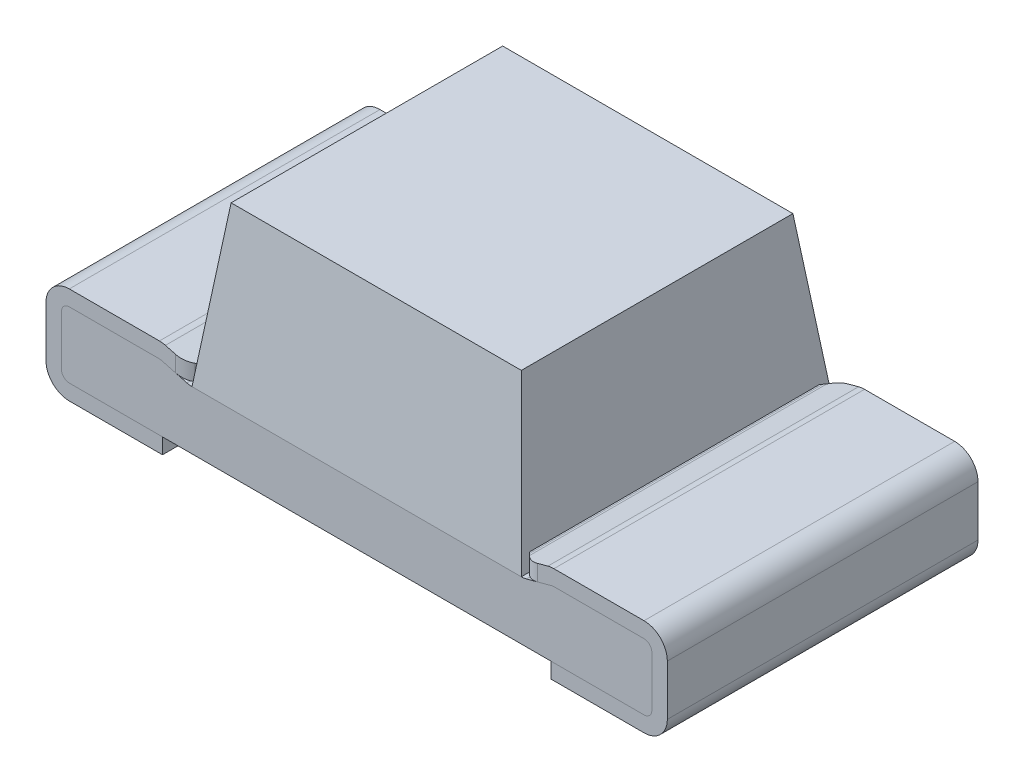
ISO-10303-21;
HEADER;
FILE_DESCRIPTION(('STEP AP214'),'2;1');
FILE_NAME('part.step','',(''),(''),'','','');
FILE_SCHEMA(('AUTOMOTIVE_DESIGN { 1 0 10303 214 1 1 1 1 }'));
ENDSEC;
DATA;
#1=APPLICATION_CONTEXT('core data for automotive mechanical design processes');
#2=APPLICATION_PROTOCOL_DEFINITION('international standard','automotive_design',2000,#1);
#3=PRODUCT_CONTEXT('',#1,'mechanical');
#4=PRODUCT('Part','Part','',(#3));
#5=PRODUCT_RELATED_PRODUCT_CATEGORY('part','',(#4));
#6=PRODUCT_DEFINITION_FORMATION('','',#4);
#7=PRODUCT_DEFINITION_CONTEXT('part definition',#1,'design');
#8=PRODUCT_DEFINITION('design','',#6,#7);
#9=PRODUCT_DEFINITION_SHAPE('','',#8);
#10=(LENGTH_UNIT() NAMED_UNIT(*) SI_UNIT(.MILLI.,.METRE.));
#11=(NAMED_UNIT(*) PLANE_ANGLE_UNIT() SI_UNIT($,.RADIAN.));
#12=(NAMED_UNIT(*) SI_UNIT($,.STERADIAN.) SOLID_ANGLE_UNIT());
#13=UNCERTAINTY_MEASURE_WITH_UNIT(LENGTH_MEASURE(1.E-05),#10,'distance_accuracy_value','');
#14=(GEOMETRIC_REPRESENTATION_CONTEXT(3) GLOBAL_UNCERTAINTY_ASSIGNED_CONTEXT((#13)) GLOBAL_UNIT_ASSIGNED_CONTEXT((#10,
#11,#12)) REPRESENTATION_CONTEXT('',''));
#15=CARTESIAN_POINT('',(0.,0.,0.));
#16=DIRECTION('',(0.,0.,1.));
#17=DIRECTION('',(1.,0.,0.));
#18=AXIS2_PLACEMENT_3D('',#15,#16,#17);
#19=CARTESIAN_POINT('',(0.424042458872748,0.19,0.4));
#20=DIRECTION('',(0.992546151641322,0.121869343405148,0.));
#21=DIRECTION('',(-0.121869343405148,0.992546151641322,0.));
#22=AXIS2_PLACEMENT_3D('',#19,#20,#21);
#23=PLANE('',#22);
#24=DIRECTION('',(0.,0.,1.));
#25=VECTOR('',#24,1.);
#26=CARTESIAN_POINT('',(0.373700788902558,0.6,0.4));
#27=LINE('',#26,#25);
#28=CARTESIAN_POINT('',(0.373700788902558,0.6,0.349658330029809));
#29=VERTEX_POINT('',#28);
#30=CARTESIAN_POINT('',(0.373700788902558,0.6,-0.349658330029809));
#31=VERTEX_POINT('',#30);
#32=EDGE_CURVE('E101',#29,#31,#27,.F.);
#33=ORIENTED_EDGE('',*,*,#32,.F.);
#34=DIRECTION('',(0.120974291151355,-0.985256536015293,0.120974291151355));
#35=VECTOR('',#34,1.);
#36=CARTESIAN_POINT('',(0.424042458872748,0.19,0.4));
#37=LINE('',#36,#35);
#38=CARTESIAN_POINT('',(0.424042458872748,0.19,0.4));
#39=VERTEX_POINT('',#38);
#40=EDGE_CURVE('E54',#29,#39,#37,.T.);
#41=ORIENTED_EDGE('',*,*,#40,.T.);
#42=DIRECTION('',(0.,0.,-1.));
#43=VECTOR('',#42,1.);
#44=CARTESIAN_POINT('',(0.424042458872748,0.19,0.4));
#45=LINE('',#44,#43);
#46=CARTESIAN_POINT('',(0.424042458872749,0.19,-0.4));
#47=VERTEX_POINT('',#46);
#48=EDGE_CURVE('E99',#39,#47,#45,.T.);
#49=ORIENTED_EDGE('',*,*,#48,.T.);
#50=DIRECTION('',(0.120974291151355,-0.985256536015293,-0.120974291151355));
#51=VECTOR('',#50,1.);
#52=CARTESIAN_POINT('',(0.411630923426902,0.291083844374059,-0.387588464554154));
#53=LINE('',#52,#51);
#54=EDGE_CURVE('E90',#31,#47,#53,.T.);
#55=ORIENTED_EDGE('',*,*,#54,.F.);
#56=EDGE_LOOP('',(#33,#41,#49,#55));
#57=FACE_BOUND('',#56,.T.);
#58=ADVANCED_FACE('F50',(#57),#23,.T.);
#59=CARTESIAN_POINT('',(-0.424042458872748,0.19,-0.4));
#60=DIRECTION('',(0.,0.121869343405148,-0.992546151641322));
#61=DIRECTION('',(0.,0.992546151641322,0.121869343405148));
#62=AXIS2_PLACEMENT_3D('',#59,#60,#61);
#63=PLANE('',#62);
#64=DIRECTION('',(1.,0.,0.));
#65=VECTOR('',#64,1.);
#66=CARTESIAN_POINT('',(-0.424042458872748,0.6,-0.349658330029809));
#67=LINE('',#66,#65);
#68=CARTESIAN_POINT('',(-0.373700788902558,0.6,-0.349658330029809));
#69=VERTEX_POINT('',#68);
#70=EDGE_CURVE('E60',#31,#69,#67,.F.);
#71=ORIENTED_EDGE('',*,*,#70,.F.);
#72=ORIENTED_EDGE('',*,*,#54,.T.);
#73=DIRECTION('',(-1.,0.,0.));
#74=VECTOR('',#73,1.);
#75=CARTESIAN_POINT('',(-0.424042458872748,0.19,-0.4));
#76=LINE('',#75,#74);
#77=CARTESIAN_POINT('',(-0.424042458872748,0.19,-0.4));
#78=VERTEX_POINT('',#77);
#79=EDGE_CURVE('E113',#47,#78,#76,.T.);
#80=ORIENTED_EDGE('',*,*,#79,.T.);
#81=DIRECTION('',(-0.120974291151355,-0.985256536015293,-0.120974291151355));
#82=VECTOR('',#81,1.);
#83=CARTESIAN_POINT('',(-0.41233463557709,0.285352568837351,-0.388292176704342));
#84=LINE('',#83,#82);
#85=EDGE_CURVE('E128',#69,#78,#84,.T.);
#86=ORIENTED_EDGE('',*,*,#85,.F.);
#87=EDGE_LOOP('',(#71,#72,#80,#86));
#88=FACE_BOUND('',#87,.T.);
#89=ADVANCED_FACE('F134',(#88),#63,.T.);
#90=CARTESIAN_POINT('',(-0.424042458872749,0.19,0.4));
#91=DIRECTION('',(-0.992546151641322,0.121869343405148,0.));
#92=DIRECTION('',(-0.121869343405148,-0.992546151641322,0.));
#93=AXIS2_PLACEMENT_3D('',#90,#91,#92);
#94=PLANE('',#93);
#95=DIRECTION('',(0.,0.,-1.));
#96=VECTOR('',#95,1.);
#97=CARTESIAN_POINT('',(-0.373700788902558,0.6,0.4));
#98=LINE('',#97,#96);
#99=CARTESIAN_POINT('',(-0.373700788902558,0.6,0.349658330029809));
#100=VERTEX_POINT('',#99);
#101=EDGE_CURVE('E14',#69,#100,#98,.F.);
#102=ORIENTED_EDGE('',*,*,#101,.F.);
#103=ORIENTED_EDGE('',*,*,#85,.T.);
#104=DIRECTION('',(0.,0.,1.));
#105=VECTOR('',#104,1.);
#106=CARTESIAN_POINT('',(-0.424042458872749,0.19,0.4));
#107=LINE('',#106,#105);
#108=CARTESIAN_POINT('',(-0.424042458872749,0.19,0.4));
#109=VERTEX_POINT('',#108);
#110=EDGE_CURVE('E130',#78,#109,#107,.T.);
#111=ORIENTED_EDGE('',*,*,#110,.T.);
#112=DIRECTION('',(-0.120974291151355,-0.985256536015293,0.120974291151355));
#113=VECTOR('',#112,1.);
#114=CARTESIAN_POINT('',(-0.424042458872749,0.19,0.4));
#115=LINE('',#114,#113);
#116=EDGE_CURVE('E73',#100,#109,#115,.T.);
#117=ORIENTED_EDGE('',*,*,#116,.F.);
#118=EDGE_LOOP('',(#102,#103,#111,#117));
#119=FACE_BOUND('',#118,.T.);
#120=ADVANCED_FACE('F133',(#119),#94,.T.);
#121=CARTESIAN_POINT('',(-0.424042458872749,0.19,0.4));
#122=DIRECTION('',(0.,0.121869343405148,0.992546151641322));
#123=DIRECTION('',(0.,-0.992546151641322,0.121869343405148));
#124=AXIS2_PLACEMENT_3D('',#121,#122,#123);
#125=PLANE('',#124);
#126=DIRECTION('',(-1.,0.,0.));
#127=VECTOR('',#126,1.);
#128=CARTESIAN_POINT('',(-0.424042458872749,0.6,0.349658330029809));
#129=LINE('',#128,#127);
#130=EDGE_CURVE('E110',#100,#29,#129,.F.);
#131=ORIENTED_EDGE('',*,*,#130,.F.);
#132=ORIENTED_EDGE('',*,*,#116,.T.);
#133=DIRECTION('',(1.,0.,0.));
#134=VECTOR('',#133,1.);
#135=CARTESIAN_POINT('',(-0.424042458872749,0.19,0.4));
#136=LINE('',#135,#134);
#137=EDGE_CURVE('E105',#109,#39,#136,.T.);
#138=ORIENTED_EDGE('',*,*,#137,.T.);
#139=ORIENTED_EDGE('',*,*,#40,.F.);
#140=EDGE_LOOP('',(#131,#132,#138,#139));
#141=FACE_BOUND('',#140,.T.);
#142=ADVANCED_FACE('F106',(#141),#125,.T.);
#143=CARTESIAN_POINT('',(0.424042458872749,0.19,-0.4));
#144=DIRECTION('',(0.,-1.,0.));
#145=DIRECTION('',(0.,0.,-1.));
#146=AXIS2_PLACEMENT_3D('',#143,#144,#145);
#147=PLANE('',#146);
#148=ORIENTED_EDGE('',*,*,#48,.F.);
#149=ORIENTED_EDGE('',*,*,#137,.F.);
#150=ORIENTED_EDGE('',*,*,#110,.F.);
#151=ORIENTED_EDGE('',*,*,#79,.F.);
#152=EDGE_LOOP('',(#148,#149,#150,#151));
#153=FACE_BOUND('',#152,.T.);
#154=ADVANCED_FACE('F112',(#153),#147,.T.);
#155=CARTESIAN_POINT('',(0.,0.6,0.));
#156=DIRECTION('',(0.,1.,0.));
#157=DIRECTION('',(0.,0.,1.));
#158=AXIS2_PLACEMENT_3D('',#155,#156,#157);
#159=PLANE('',#158);
#160=ORIENTED_EDGE('',*,*,#130,.T.);
#161=ORIENTED_EDGE('',*,*,#32,.T.);
#162=ORIENTED_EDGE('',*,*,#70,.T.);
#163=ORIENTED_EDGE('',*,*,#101,.T.);
#164=EDGE_LOOP('',(#160,#161,#162,#163));
#165=FACE_BOUND('',#164,.T.);
#166=ADVANCED_FACE('F52',(#165),#159,.T.);
#167=CLOSED_SHELL('',(#58,#89,#120,#142,#154,#166));
#168=MANIFOLD_SOLID_BREP('B2',#167);
#169=CARTESIAN_POINT('',(0.74,0.0600000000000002,1.92947703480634));
#170=DIRECTION('',(0.,0.,-1.));
#171=DIRECTION('',(-1.,0.,0.));
#172=AXIS2_PLACEMENT_3D('',#169,#170,#171);
#173=CYLINDRICAL_SURFACE('',#172,0.02);
#174=CARTESIAN_POINT('',(0.74,0.0600000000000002,0.4));
#175=DIRECTION('',(0.,0.,1.));
#176=DIRECTION('',(1.,0.,0.));
#177=AXIS2_PLACEMENT_3D('',#174,#175,#176);
#178=CIRCLE('',#177,0.02);
#179=CARTESIAN_POINT('',(0.74,0.0400000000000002,0.4));
#180=VERTEX_POINT('',#179);
#181=CARTESIAN_POINT('',(0.76,0.0600000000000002,0.4));
#182=VERTEX_POINT('',#181);
#183=EDGE_CURVE('E348',#180,#182,#178,.T.);
#184=ORIENTED_EDGE('',*,*,#183,.F.);
#185=DIRECTION('',(0.,0.,-1.));
#186=VECTOR('',#185,1.);
#187=CARTESIAN_POINT('',(0.74,0.0400000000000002,1.92947703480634));
#188=LINE('',#187,#186);
#189=CARTESIAN_POINT('',(0.74,0.0400000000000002,-0.4));
#190=VERTEX_POINT('',#189);
#191=EDGE_CURVE('E205',#180,#190,#188,.T.);
#192=ORIENTED_EDGE('',*,*,#191,.T.);
#193=CARTESIAN_POINT('',(0.74,0.0600000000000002,-0.4));
#194=DIRECTION('',(0.,0.,1.));
#195=DIRECTION('',(1.,0.,0.));
#196=AXIS2_PLACEMENT_3D('',#193,#194,#195);
#197=CIRCLE('',#196,0.02);
#198=CARTESIAN_POINT('',(0.76,0.0600000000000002,-0.4));
#199=VERTEX_POINT('',#198);
#200=EDGE_CURVE('E417',#199,#190,#197,.F.);
#201=ORIENTED_EDGE('',*,*,#200,.F.);
#202=DIRECTION('',(0.,0.,-1.));
#203=VECTOR('',#202,1.);
#204=CARTESIAN_POINT('',(0.76,0.0600000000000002,1.92947703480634));
#205=LINE('',#204,#203);
#206=EDGE_CURVE('E355',#182,#199,#205,.T.);
#207=ORIENTED_EDGE('',*,*,#206,.F.);
#208=EDGE_LOOP('',(#184,#192,#201,#207));
#209=FACE_BOUND('',#208,.T.);
#210=ADVANCED_FACE('F201',(#209),#173,.T.);
#211=CARTESIAN_POINT('',(0.76,0.0600000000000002,1.92947703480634));
#212=DIRECTION('',(-1.,0.,0.));
#213=DIRECTION('',(0.,0.,1.));
#214=AXIS2_PLACEMENT_3D('',#211,#212,#213);
#215=PLANE('',#214);
#216=DIRECTION('',(0.,1.,0.));
#217=VECTOR('',#216,1.);
#218=CARTESIAN_POINT('',(0.76,0.0600000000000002,0.4));
#219=LINE('',#218,#217);
#220=CARTESIAN_POINT('',(0.76,0.19,0.4));
#221=VERTEX_POINT('',#220);
#222=EDGE_CURVE('E344',#182,#221,#219,.T.);
#223=ORIENTED_EDGE('',*,*,#222,.F.);
#224=ORIENTED_EDGE('',*,*,#206,.T.);
#225=DIRECTION('',(0.,-1.,0.));
#226=VECTOR('',#225,1.);
#227=CARTESIAN_POINT('',(0.76,0.0600000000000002,-0.4));
#228=LINE('',#227,#226);
#229=CARTESIAN_POINT('',(0.76,0.19,-0.4));
#230=VERTEX_POINT('',#229);
#231=EDGE_CURVE('E431',#230,#199,#228,.T.);
#232=ORIENTED_EDGE('',*,*,#231,.F.);
#233=DIRECTION('',(0.,0.,-1.));
#234=VECTOR('',#233,1.);
#235=CARTESIAN_POINT('',(0.76,0.19,1.92947703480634));
#236=LINE('',#235,#234);
#237=EDGE_CURVE('E359',#221,#230,#236,.T.);
#238=ORIENTED_EDGE('',*,*,#237,.F.);
#239=EDGE_LOOP('',(#223,#224,#232,#238));
#240=FACE_BOUND('',#239,.T.);
#241=ADVANCED_FACE('F513',(#240),#215,.F.);
#242=CARTESIAN_POINT('',(0.74,0.19,1.92947703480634));
#243=DIRECTION('',(0.,0.,-1.));
#244=DIRECTION('',(-1.,0.,0.));
#245=AXIS2_PLACEMENT_3D('',#242,#243,#244);
#246=CYLINDRICAL_SURFACE('',#245,0.02);
#247=CARTESIAN_POINT('',(0.74,0.19,0.4));
#248=DIRECTION('',(0.,0.,1.));
#249=DIRECTION('',(1.,0.,0.));
#250=AXIS2_PLACEMENT_3D('',#247,#248,#249);
#251=CIRCLE('',#250,0.02);
#252=CARTESIAN_POINT('',(0.74,0.21,0.4));
#253=VERTEX_POINT('',#252);
#254=EDGE_CURVE('E340',#221,#253,#251,.T.);
#255=ORIENTED_EDGE('',*,*,#254,.F.);
#256=ORIENTED_EDGE('',*,*,#237,.T.);
#257=CARTESIAN_POINT('',(0.74,0.19,-0.4));
#258=DIRECTION('',(0.,0.,1.));
#259=DIRECTION('',(1.,0.,0.));
#260=AXIS2_PLACEMENT_3D('',#257,#258,#259);
#261=CIRCLE('',#260,0.02);
#262=CARTESIAN_POINT('',(0.74,0.21,-0.4));
#263=VERTEX_POINT('',#262);
#264=EDGE_CURVE('E509',#263,#230,#261,.F.);
#265=ORIENTED_EDGE('',*,*,#264,.F.);
#266=DIRECTION('',(0.,0.,-1.));
#267=VECTOR('',#266,1.);
#268=CARTESIAN_POINT('',(0.74,0.21,1.92947703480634));
#269=LINE('',#268,#267);
#270=EDGE_CURVE('E363',#253,#263,#269,.T.);
#271=ORIENTED_EDGE('',*,*,#270,.F.);
#272=EDGE_LOOP('',(#255,#256,#265,#271));
#273=FACE_BOUND('',#272,.T.);
#274=ADVANCED_FACE('F514',(#273),#246,.T.);
#275=CARTESIAN_POINT('',(0.74,0.21,1.92947703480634));
#276=DIRECTION('',(0.,-1.,0.));
#277=DIRECTION('',(1.,0.,0.));
#278=AXIS2_PLACEMENT_3D('',#275,#276,#277);
#279=PLANE('',#278);
#280=DIRECTION('',(-1.,0.,0.));
#281=VECTOR('',#280,1.);
#282=CARTESIAN_POINT('',(0.74,0.21,0.4));
#283=LINE('',#282,#281);
#284=CARTESIAN_POINT('',(0.507899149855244,0.21,0.4));
#285=VERTEX_POINT('',#284);
#286=EDGE_CURVE('E336',#253,#285,#283,.T.);
#287=ORIENTED_EDGE('',*,*,#286,.F.);
#288=ORIENTED_EDGE('',*,*,#270,.T.);
#289=DIRECTION('',(1.,0.,0.));
#290=VECTOR('',#289,1.);
#291=CARTESIAN_POINT('',(0.74,0.21,-0.4));
#292=LINE('',#291,#290);
#293=CARTESIAN_POINT('',(0.507899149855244,0.21,-0.4));
#294=VERTEX_POINT('',#293);
#295=EDGE_CURVE('E506',#294,#263,#292,.T.);
#296=ORIENTED_EDGE('',*,*,#295,.F.);
#297=DIRECTION('',(0.,0.,-1.));
#298=VECTOR('',#297,1.);
#299=CARTESIAN_POINT('',(0.507899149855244,0.21,1.92947703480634));
#300=LINE('',#299,#298);
#301=EDGE_CURVE('E367',#285,#294,#300,.T.);
#302=ORIENTED_EDGE('',*,*,#301,.F.);
#303=EDGE_LOOP('',(#287,#288,#296,#302));
#304=FACE_BOUND('',#303,.T.);
#305=ADVANCED_FACE('F516',(#304),#279,.F.);
#306=CARTESIAN_POINT('',(0.507899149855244,0.19,1.92947703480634));
#307=DIRECTION('',(0.,0.,-1.));
#308=DIRECTION('',(-1.,0.,0.));
#309=AXIS2_PLACEMENT_3D('',#306,#307,#308);
#310=CYLINDRICAL_SURFACE('',#309,0.02);
#311=CARTESIAN_POINT('',(0.507899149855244,0.19,0.4));
#312=DIRECTION('',(0.,0.,1.));
#313=DIRECTION('',(1.,0.,0.));
#314=AXIS2_PLACEMENT_3D('',#311,#312,#313);
#315=CIRCLE('',#314,0.02);
#316=CARTESIAN_POINT('',(0.502722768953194,0.209318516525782,0.4));
#317=VERTEX_POINT('',#316);
#318=EDGE_CURVE('E332',#285,#317,#315,.T.);
#319=ORIENTED_EDGE('',*,*,#318,.F.);
#320=ORIENTED_EDGE('',*,*,#301,.T.);
#321=CARTESIAN_POINT('',(0.507899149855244,0.19,-0.4));
#322=DIRECTION('',(0.,0.,1.));
#323=DIRECTION('',(1.,0.,0.));
#324=AXIS2_PLACEMENT_3D('',#321,#322,#323);
#325=CIRCLE('',#324,0.02);
#326=CARTESIAN_POINT('',(0.502722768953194,0.209318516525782,-0.4));
#327=VERTEX_POINT('',#326);
#328=EDGE_CURVE('E503',#327,#294,#325,.F.);
#329=ORIENTED_EDGE('',*,*,#328,.F.);
#330=DIRECTION('',(0.,0.,-1.));
#331=VECTOR('',#330,1.);
#332=CARTESIAN_POINT('',(0.502722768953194,0.209318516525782,1.92947703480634));
#333=LINE('',#332,#331);
#334=EDGE_CURVE('E371',#317,#327,#333,.T.);
#335=ORIENTED_EDGE('',*,*,#334,.F.);
#336=EDGE_LOOP('',(#319,#320,#329,#335));
#337=FACE_BOUND('',#336,.T.);
#338=ADVANCED_FACE('F522',(#337),#310,.T.);
#339=CARTESIAN_POINT('',(0.502722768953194,0.209318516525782,1.92947703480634));
#340=DIRECTION('',(0.258819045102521,-0.965925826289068,0.));
#341=DIRECTION('',(0.965925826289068,0.258819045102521,0.));
#342=AXIS2_PLACEMENT_3D('',#339,#340,#341);
#343=PLANE('',#342);
#344=DIRECTION('',(-0.965925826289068,-0.258819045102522,0.));
#345=VECTOR('',#344,1.);
#346=CARTESIAN_POINT('',(0.502722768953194,0.209318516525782,0.4));
#347=LINE('',#346,#345);
#348=CARTESIAN_POINT('',(0.436983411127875,0.191703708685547,0.4));
#349=VERTEX_POINT('',#348);
#350=EDGE_CURVE('E328',#317,#349,#347,.T.);
#351=ORIENTED_EDGE('',*,*,#350,.F.);
#352=ORIENTED_EDGE('',*,*,#334,.T.);
#353=DIRECTION('',(0.965925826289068,0.258819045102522,0.));
#354=VECTOR('',#353,1.);
#355=CARTESIAN_POINT('',(0.502722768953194,0.209318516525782,-0.4));
#356=LINE('',#355,#354);
#357=CARTESIAN_POINT('',(0.436983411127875,0.191703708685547,-0.4));
#358=VERTEX_POINT('',#357);
#359=EDGE_CURVE('E500',#358,#327,#356,.T.);
#360=ORIENTED_EDGE('',*,*,#359,.F.);
#361=DIRECTION('',(0.,0.,-1.));
#362=VECTOR('',#361,1.);
#363=CARTESIAN_POINT('',(0.436983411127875,0.191703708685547,1.92947703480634));
#364=LINE('',#363,#362);
#365=EDGE_CURVE('E375',#349,#358,#364,.T.);
#366=ORIENTED_EDGE('',*,*,#365,.F.);
#367=EDGE_LOOP('',(#351,#352,#360,#366));
#368=FACE_BOUND('',#367,.T.);
#369=ADVANCED_FACE('F546',(#368),#343,.F.);
#370=CARTESIAN_POINT('',(0.424042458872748,0.24,1.92947703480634));
#371=DIRECTION('',(0.,0.,-1.));
#372=DIRECTION('',(-1.,0.,0.));
#373=AXIS2_PLACEMENT_3D('',#370,#371,#372);
#374=CYLINDRICAL_SURFACE('',#373,0.05);
#375=CARTESIAN_POINT('',(0.424042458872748,0.24,0.4));
#376=DIRECTION('',(0.,0.,1.));
#377=DIRECTION('',(1.,0.,0.));
#378=AXIS2_PLACEMENT_3D('',#375,#376,#377);
#379=CIRCLE('',#378,0.05);
#380=CARTESIAN_POINT('',(0.424042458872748,0.19,0.4));
#381=VERTEX_POINT('',#380);
#382=EDGE_CURVE('E324',#349,#381,#379,.F.);
#383=ORIENTED_EDGE('',*,*,#382,.F.);
#384=ORIENTED_EDGE('',*,*,#365,.T.);
#385=CARTESIAN_POINT('',(0.424042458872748,0.24,-0.4));
#386=DIRECTION('',(0.,0.,1.));
#387=DIRECTION('',(1.,0.,0.));
#388=AXIS2_PLACEMENT_3D('',#385,#386,#387);
#389=CIRCLE('',#388,0.05);
#390=CARTESIAN_POINT('',(0.424042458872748,0.19,-0.4));
#391=VERTEX_POINT('',#390);
#392=EDGE_CURVE('E496',#391,#358,#389,.T.);
#393=ORIENTED_EDGE('',*,*,#392,.F.);
#394=DIRECTION('',(0.,0.,-1.));
#395=VECTOR('',#394,1.);
#396=CARTESIAN_POINT('',(0.424042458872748,0.19,1.92947703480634));
#397=LINE('',#396,#395);
#398=EDGE_CURVE('E379',#381,#391,#397,.T.);
#399=ORIENTED_EDGE('',*,*,#398,.F.);
#400=EDGE_LOOP('',(#383,#384,#393,#399));
#401=FACE_BOUND('',#400,.T.);
#402=ADVANCED_FACE('F554',(#401),#374,.F.);
#403=CARTESIAN_POINT('',(-0.424042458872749,0.19,1.92947703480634));
#404=DIRECTION('',(0.,-1.,0.));
#405=DIRECTION('',(0.,0.,-1.));
#406=AXIS2_PLACEMENT_3D('',#403,#404,#405);
#407=PLANE('',#406);
#408=DIRECTION('',(-1.,0.,0.));
#409=VECTOR('',#408,1.);
#410=CARTESIAN_POINT('',(-0.424042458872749,0.19,0.4));
#411=LINE('',#410,#409);
#412=CARTESIAN_POINT('',(-0.424042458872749,0.19,0.4));
#413=VERTEX_POINT('',#412);
#414=EDGE_CURVE('E320',#381,#413,#411,.T.);
#415=ORIENTED_EDGE('',*,*,#414,.F.);
#416=ORIENTED_EDGE('',*,*,#398,.T.);
#417=DIRECTION('',(1.,0.,0.));
#418=VECTOR('',#417,1.);
#419=CARTESIAN_POINT('',(-0.424042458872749,0.19,-0.4));
#420=LINE('',#419,#418);
#421=CARTESIAN_POINT('',(-0.424042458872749,0.19,-0.4));
#422=VERTEX_POINT('',#421);
#423=EDGE_CURVE('E493',#422,#391,#420,.T.);
#424=ORIENTED_EDGE('',*,*,#423,.F.);
#425=DIRECTION('',(0.,0.,-1.));
#426=VECTOR('',#425,1.);
#427=CARTESIAN_POINT('',(-0.424042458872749,0.19,1.92947703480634));
#428=LINE('',#427,#426);
#429=EDGE_CURVE('E383',#413,#422,#428,.T.);
#430=ORIENTED_EDGE('',*,*,#429,.F.);
#431=EDGE_LOOP('',(#415,#416,#424,#430));
#432=FACE_BOUND('',#431,.T.);
#433=ADVANCED_FACE('F563',(#432),#407,.F.);
#434=CARTESIAN_POINT('',(-0.424042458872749,0.24,1.92947703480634));
#435=DIRECTION('',(0.,0.,-1.));
#436=DIRECTION('',(-1.,0.,0.));
#437=AXIS2_PLACEMENT_3D('',#434,#435,#436);
#438=CYLINDRICAL_SURFACE('',#437,0.05);
#439=CARTESIAN_POINT('',(-0.424042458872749,0.24,0.4));
#440=DIRECTION('',(0.,0.,1.));
#441=DIRECTION('',(1.,0.,0.));
#442=AXIS2_PLACEMENT_3D('',#439,#440,#441);
#443=CIRCLE('',#442,0.05);
#444=CARTESIAN_POINT('',(-0.436983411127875,0.191703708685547,0.4));
#445=VERTEX_POINT('',#444);
#446=EDGE_CURVE('E316',#413,#445,#443,.F.);
#447=ORIENTED_EDGE('',*,*,#446,.F.);
#448=ORIENTED_EDGE('',*,*,#429,.T.);
#449=CARTESIAN_POINT('',(-0.424042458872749,0.24,-0.4));
#450=DIRECTION('',(0.,0.,1.));
#451=DIRECTION('',(1.,0.,0.));
#452=AXIS2_PLACEMENT_3D('',#449,#450,#451);
#453=CIRCLE('',#452,0.05);
#454=CARTESIAN_POINT('',(-0.436983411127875,0.191703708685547,-0.4));
#455=VERTEX_POINT('',#454);
#456=EDGE_CURVE('E489',#455,#422,#453,.T.);
#457=ORIENTED_EDGE('',*,*,#456,.F.);
#458=DIRECTION('',(0.,0.,-1.));
#459=VECTOR('',#458,1.);
#460=CARTESIAN_POINT('',(-0.436983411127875,0.191703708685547,1.92947703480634));
#461=LINE('',#460,#459);
#462=EDGE_CURVE('E387',#445,#455,#461,.T.);
#463=ORIENTED_EDGE('',*,*,#462,.F.);
#464=EDGE_LOOP('',(#447,#448,#457,#463));
#465=FACE_BOUND('',#464,.T.);
#466=ADVANCED_FACE('F572',(#465),#438,.F.);
#467=CARTESIAN_POINT('',(-0.436983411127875,0.191703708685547,1.92947703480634));
#468=DIRECTION('',(-0.258819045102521,-0.965925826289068,0.));
#469=DIRECTION('',(0.965925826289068,-0.258819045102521,0.));
#470=AXIS2_PLACEMENT_3D('',#467,#468,#469);
#471=PLANE('',#470);
#472=DIRECTION('',(-0.965925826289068,0.258819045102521,0.));
#473=VECTOR('',#472,1.);
#474=CARTESIAN_POINT('',(-0.436983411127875,0.191703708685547,0.4));
#475=LINE('',#474,#473);
#476=CARTESIAN_POINT('',(-0.502722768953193,0.209318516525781,0.4));
#477=VERTEX_POINT('',#476);
#478=EDGE_CURVE('E312',#445,#477,#475,.T.);
#479=ORIENTED_EDGE('',*,*,#478,.F.);
#480=ORIENTED_EDGE('',*,*,#462,.T.);
#481=DIRECTION('',(0.965925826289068,-0.258819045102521,0.));
#482=VECTOR('',#481,1.);
#483=CARTESIAN_POINT('',(-0.436983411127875,0.191703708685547,-0.4));
#484=LINE('',#483,#482);
#485=CARTESIAN_POINT('',(-0.502722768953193,0.209318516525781,-0.4));
#486=VERTEX_POINT('',#485);
#487=EDGE_CURVE('E483',#486,#455,#484,.T.);
#488=ORIENTED_EDGE('',*,*,#487,.F.);
#489=DIRECTION('',(0.,0.,-1.));
#490=VECTOR('',#489,1.);
#491=CARTESIAN_POINT('',(-0.502722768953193,0.209318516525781,1.92947703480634));
#492=LINE('',#491,#490);
#493=EDGE_CURVE('E391',#477,#486,#492,.T.);
#494=ORIENTED_EDGE('',*,*,#493,.F.);
#495=EDGE_LOOP('',(#479,#480,#488,#494));
#496=FACE_BOUND('',#495,.T.);
#497=ADVANCED_FACE('F581',(#496),#471,.F.);
#498=CARTESIAN_POINT('',(-0.507899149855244,0.19,1.92947703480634));
#499=DIRECTION('',(0.,0.,-1.));
#500=DIRECTION('',(-1.,0.,0.));
#501=AXIS2_PLACEMENT_3D('',#498,#499,#500);
#502=CYLINDRICAL_SURFACE('',#501,0.02);
#503=CARTESIAN_POINT('',(-0.507899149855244,0.19,0.4));
#504=DIRECTION('',(0.,0.,1.));
#505=DIRECTION('',(1.,0.,0.));
#506=AXIS2_PLACEMENT_3D('',#503,#504,#505);
#507=CIRCLE('',#506,0.02);
#508=CARTESIAN_POINT('',(-0.507899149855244,0.21,0.4));
#509=VERTEX_POINT('',#508);
#510=EDGE_CURVE('E307',#477,#509,#507,.T.);
#511=ORIENTED_EDGE('',*,*,#510,.F.);
#512=ORIENTED_EDGE('',*,*,#493,.T.);
#513=CARTESIAN_POINT('',(-0.507899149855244,0.19,-0.4));
#514=DIRECTION('',(0.,0.,1.));
#515=DIRECTION('',(1.,0.,0.));
#516=AXIS2_PLACEMENT_3D('',#513,#514,#515);
#517=CIRCLE('',#516,0.02);
#518=CARTESIAN_POINT('',(-0.507899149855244,0.21,-0.4));
#519=VERTEX_POINT('',#518);
#520=EDGE_CURVE('E480',#519,#486,#517,.F.);
#521=ORIENTED_EDGE('',*,*,#520,.F.);
#522=DIRECTION('',(0.,0.,-1.));
#523=VECTOR('',#522,1.);
#524=CARTESIAN_POINT('',(-0.507899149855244,0.21,1.92947703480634));
#525=LINE('',#524,#523);
#526=EDGE_CURVE('E395',#509,#519,#525,.T.);
#527=ORIENTED_EDGE('',*,*,#526,.F.);
#528=EDGE_LOOP('',(#511,#512,#521,#527));
#529=FACE_BOUND('',#528,.T.);
#530=ADVANCED_FACE('F590',(#529),#502,.T.);
#531=CARTESIAN_POINT('',(-0.507899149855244,0.21,1.92947703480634));
#532=DIRECTION('',(0.,-1.,0.));
#533=DIRECTION('',(1.,0.,0.));
#534=AXIS2_PLACEMENT_3D('',#531,#532,#533);
#535=PLANE('',#534);
#536=DIRECTION('',(-1.,0.,0.));
#537=VECTOR('',#536,1.);
#538=CARTESIAN_POINT('',(-0.507899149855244,0.21,0.4));
#539=LINE('',#538,#537);
#540=CARTESIAN_POINT('',(-0.74,0.21,0.4));
#541=VERTEX_POINT('',#540);
#542=EDGE_CURVE('E301',#509,#541,#539,.T.);
#543=ORIENTED_EDGE('',*,*,#542,.F.);
#544=ORIENTED_EDGE('',*,*,#526,.T.);
#545=DIRECTION('',(1.,0.,0.));
#546=VECTOR('',#545,1.);
#547=CARTESIAN_POINT('',(-0.507899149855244,0.21,-0.4));
#548=LINE('',#547,#546);
#549=CARTESIAN_POINT('',(-0.74,0.21,-0.4));
#550=VERTEX_POINT('',#549);
#551=EDGE_CURVE('E474',#550,#519,#548,.T.);
#552=ORIENTED_EDGE('',*,*,#551,.F.);
#553=DIRECTION('',(0.,0.,-1.));
#554=VECTOR('',#553,1.);
#555=CARTESIAN_POINT('',(-0.74,0.21,1.92947703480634));
#556=LINE('',#555,#554);
#557=EDGE_CURVE('E296',#541,#550,#556,.T.);
#558=ORIENTED_EDGE('',*,*,#557,.F.);
#559=EDGE_LOOP('',(#543,#544,#552,#558));
#560=FACE_BOUND('',#559,.T.);
#561=ADVANCED_FACE('F477',(#560),#535,.F.);
#562=CARTESIAN_POINT('',(-0.74,0.19,1.92947703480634));
#563=DIRECTION('',(0.,0.,-1.));
#564=DIRECTION('',(-1.,0.,0.));
#565=AXIS2_PLACEMENT_3D('',#562,#563,#564);
#566=CYLINDRICAL_SURFACE('',#565,0.02);
#567=CARTESIAN_POINT('',(-0.74,0.19,0.4));
#568=DIRECTION('',(0.,0.,1.));
#569=DIRECTION('',(1.,0.,0.));
#570=AXIS2_PLACEMENT_3D('',#567,#568,#569);
#571=CIRCLE('',#570,0.02);
#572=CARTESIAN_POINT('',(-0.76,0.19,0.4));
#573=VERTEX_POINT('',#572);
#574=EDGE_CURVE('E286',#541,#573,#571,.T.);
#575=ORIENTED_EDGE('',*,*,#574,.F.);
#576=ORIENTED_EDGE('',*,*,#557,.T.);
#577=CARTESIAN_POINT('',(-0.74,0.19,-0.4));
#578=DIRECTION('',(0.,0.,1.));
#579=DIRECTION('',(1.,0.,0.));
#580=AXIS2_PLACEMENT_3D('',#577,#578,#579);
#581=CIRCLE('',#580,0.02);
#582=CARTESIAN_POINT('',(-0.76,0.19,-0.4));
#583=VERTEX_POINT('',#582);
#584=EDGE_CURVE('E294',#583,#550,#581,.F.);
#585=ORIENTED_EDGE('',*,*,#584,.F.);
#586=DIRECTION('',(0.,0.,-1.));
#587=VECTOR('',#586,1.);
#588=CARTESIAN_POINT('',(-0.76,0.19,1.92947703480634));
#589=LINE('',#588,#587);
#590=EDGE_CURVE('E279',#573,#583,#589,.T.);
#591=ORIENTED_EDGE('',*,*,#590,.F.);
#592=EDGE_LOOP('',(#575,#576,#585,#591));
#593=FACE_BOUND('',#592,.T.);
#594=ADVANCED_FACE('F290',(#593),#566,.T.);
#595=CARTESIAN_POINT('',(-0.76,0.19,1.92947703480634));
#596=DIRECTION('',(1.,0.,0.));
#597=DIRECTION('',(0.,0.,-1.));
#598=AXIS2_PLACEMENT_3D('',#595,#596,#597);
#599=PLANE('',#598);
#600=DIRECTION('',(0.,-1.,0.));
#601=VECTOR('',#600,1.);
#602=CARTESIAN_POINT('',(-0.76,0.19,0.4));
#603=LINE('',#602,#601);
#604=CARTESIAN_POINT('',(-0.76,0.0600000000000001,0.4));
#605=VERTEX_POINT('',#604);
#606=EDGE_CURVE('E211',#573,#605,#603,.T.);
#607=ORIENTED_EDGE('',*,*,#606,.F.);
#608=ORIENTED_EDGE('',*,*,#590,.T.);
#609=DIRECTION('',(0.,1.,0.));
#610=VECTOR('',#609,1.);
#611=CARTESIAN_POINT('',(-0.76,0.19,-0.4));
#612=LINE('',#611,#610);
#613=CARTESIAN_POINT('',(-0.76,0.0600000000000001,-0.4));
#614=VERTEX_POINT('',#613);
#615=EDGE_CURVE('E422',#614,#583,#612,.T.);
#616=ORIENTED_EDGE('',*,*,#615,.F.);
#617=DIRECTION('',(0.,0.,-1.));
#618=VECTOR('',#617,1.);
#619=CARTESIAN_POINT('',(-0.76,0.0600000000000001,1.92947703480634));
#620=LINE('',#619,#618);
#621=EDGE_CURVE('E282',#605,#614,#620,.T.);
#622=ORIENTED_EDGE('',*,*,#621,.F.);
#623=EDGE_LOOP('',(#607,#608,#616,#622));
#624=FACE_BOUND('',#623,.T.);
#625=ADVANCED_FACE('F276',(#624),#599,.F.);
#626=CARTESIAN_POINT('',(-0.74,0.0600000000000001,1.92947703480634));
#627=DIRECTION('',(0.,0.,-1.));
#628=DIRECTION('',(-1.,0.,0.));
#629=AXIS2_PLACEMENT_3D('',#626,#627,#628);
#630=CYLINDRICAL_SURFACE('',#629,0.02);
#631=CARTESIAN_POINT('',(-0.74,0.0600000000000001,0.4));
#632=DIRECTION('',(0.,0.,1.));
#633=DIRECTION('',(1.,0.,0.));
#634=AXIS2_PLACEMENT_3D('',#631,#632,#633);
#635=CIRCLE('',#634,0.02);
#636=CARTESIAN_POINT('',(-0.74,0.0400000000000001,0.4));
#637=VERTEX_POINT('',#636);
#638=EDGE_CURVE('E48',#605,#637,#635,.T.);
#639=ORIENTED_EDGE('',*,*,#638,.F.);
#640=ORIENTED_EDGE('',*,*,#621,.T.);
#641=CARTESIAN_POINT('',(-0.74,0.0600000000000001,-0.4));
#642=DIRECTION('',(0.,0.,1.));
#643=DIRECTION('',(1.,0.,0.));
#644=AXIS2_PLACEMENT_3D('',#641,#642,#643);
#645=CIRCLE('',#644,0.02);
#646=CARTESIAN_POINT('',(-0.74,0.04,-0.4));
#647=VERTEX_POINT('',#646);
#648=EDGE_CURVE('E414',#647,#614,#645,.F.);
#649=ORIENTED_EDGE('',*,*,#648,.F.);
#650=DIRECTION('',(0.,0.,-1.));
#651=VECTOR('',#650,1.);
#652=CARTESIAN_POINT('',(-0.74,0.0400000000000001,1.92947703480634));
#653=LINE('',#652,#651);
#654=EDGE_CURVE('E227',#637,#647,#653,.T.);
#655=ORIENTED_EDGE('',*,*,#654,.F.);
#656=EDGE_LOOP('',(#639,#640,#649,#655));
#657=FACE_BOUND('',#656,.T.);
#658=ADVANCED_FACE('F420',(#657),#630,.T.);
#659=CARTESIAN_POINT('',(-0.74,0.0400000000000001,1.92947703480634));
#660=DIRECTION('',(0.,1.,0.));
#661=DIRECTION('',(-1.,0.,0.));
#662=AXIS2_PLACEMENT_3D('',#659,#660,#661);
#663=PLANE('',#662);
#664=DIRECTION('',(1.,0.,0.));
#665=VECTOR('',#664,1.);
#666=CARTESIAN_POINT('',(-0.74,0.0400000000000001,0.4));
#667=LINE('',#666,#665);
#668=EDGE_CURVE('E352',#637,#180,#667,.T.);
#669=ORIENTED_EDGE('',*,*,#668,.F.);
#670=ORIENTED_EDGE('',*,*,#654,.T.);
#671=DIRECTION('',(-1.,0.,0.));
#672=VECTOR('',#671,1.);
#673=CARTESIAN_POINT('',(-0.74,0.0400000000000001,-0.4));
#674=LINE('',#673,#672);
#675=EDGE_CURVE('E407',#190,#647,#674,.T.);
#676=ORIENTED_EDGE('',*,*,#675,.F.);
#677=ORIENTED_EDGE('',*,*,#191,.F.);
#678=EDGE_LOOP('',(#669,#670,#676,#677));
#679=FACE_BOUND('',#678,.T.);
#680=ADVANCED_FACE('F405',(#679),#663,.F.);
#681=CARTESIAN_POINT('',(-0.74,0.0600000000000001,0.4));
#682=DIRECTION('',(0.,0.,1.));
#683=DIRECTION('',(1.,0.,0.));
#684=AXIS2_PLACEMENT_3D('',#681,#682,#683);
#685=PLANE('',#684);
#686=ORIENTED_EDGE('',*,*,#668,.T.);
#687=ORIENTED_EDGE('',*,*,#183,.T.);
#688=ORIENTED_EDGE('',*,*,#222,.T.);
#689=ORIENTED_EDGE('',*,*,#254,.T.);
#690=ORIENTED_EDGE('',*,*,#286,.T.);
#691=ORIENTED_EDGE('',*,*,#318,.T.);
#692=ORIENTED_EDGE('',*,*,#350,.T.);
#693=ORIENTED_EDGE('',*,*,#382,.T.);
#694=ORIENTED_EDGE('',*,*,#414,.T.);
#695=ORIENTED_EDGE('',*,*,#446,.T.);
#696=ORIENTED_EDGE('',*,*,#478,.T.);
#697=ORIENTED_EDGE('',*,*,#510,.T.);
#698=ORIENTED_EDGE('',*,*,#542,.T.);
#699=ORIENTED_EDGE('',*,*,#574,.T.);
#700=ORIENTED_EDGE('',*,*,#606,.T.);
#701=ORIENTED_EDGE('',*,*,#638,.T.);
#702=EDGE_LOOP('',(#686,#687,#688,#689,#690,#691,#692,#693,#694,#695,#696,#697,#698,#699,#700,#701));
#703=FACE_BOUND('',#702,.T.);
#704=ADVANCED_FACE('F203',(#703),#685,.T.);
#705=CARTESIAN_POINT('',(-0.74,0.0600000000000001,-0.4));
#706=DIRECTION('',(0.,0.,1.));
#707=DIRECTION('',(1.,0.,0.));
#708=AXIS2_PLACEMENT_3D('',#705,#706,#707);
#709=PLANE('',#708);
#710=ORIENTED_EDGE('',*,*,#200,.T.);
#711=ORIENTED_EDGE('',*,*,#675,.T.);
#712=ORIENTED_EDGE('',*,*,#648,.T.);
#713=ORIENTED_EDGE('',*,*,#615,.T.);
#714=ORIENTED_EDGE('',*,*,#584,.T.);
#715=ORIENTED_EDGE('',*,*,#551,.T.);
#716=ORIENTED_EDGE('',*,*,#520,.T.);
#717=ORIENTED_EDGE('',*,*,#487,.T.);
#718=ORIENTED_EDGE('',*,*,#456,.T.);
#719=ORIENTED_EDGE('',*,*,#423,.T.);
#720=ORIENTED_EDGE('',*,*,#392,.T.);
#721=ORIENTED_EDGE('',*,*,#359,.T.);
#722=ORIENTED_EDGE('',*,*,#328,.T.);
#723=ORIENTED_EDGE('',*,*,#295,.T.);
#724=ORIENTED_EDGE('',*,*,#264,.T.);
#725=ORIENTED_EDGE('',*,*,#231,.T.);
#726=EDGE_LOOP('',(#710,#711,#712,#713,#714,#715,#716,#717,#718,#719,#720,#721,#722,#723,#724,#725));
#727=FACE_BOUND('',#726,.T.);
#728=ADVANCED_FACE('F413',(#727),#709,.F.);
#729=CLOSED_SHELL('',(#210,#241,#274,#305,#338,#369,#402,#433,#466,#497,#530,#561,#594,#625,
#658,#680,#704,#728));
#730=MANIFOLD_SOLID_BREP('B8',#729);
#731=CARTESIAN_POINT('',(-0.74,0.0600000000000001,0.4));
#732=DIRECTION('',(0.,0.,1.));
#733=DIRECTION('',(1.,0.,0.));
#734=AXIS2_PLACEMENT_3D('',#731,#732,#733);
#735=PLANE('',#734);
#736=DIRECTION('',(-0.965925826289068,0.258819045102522,0.));
#737=VECTOR('',#736,1.);
#738=CARTESIAN_POINT('',(-0.502722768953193,0.209318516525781,0.4));
#739=LINE('',#738,#737);
#740=CARTESIAN_POINT('',(-0.466069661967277,0.199497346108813,0.4));
#741=VERTEX_POINT('',#740);
#742=CARTESIAN_POINT('',(-0.502722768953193,0.209318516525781,0.4));
#743=VERTEX_POINT('',#742);
#744=EDGE_CURVE('E1148',#741,#743,#739,.T.);
#745=ORIENTED_EDGE('',*,*,#744,.F.);
#746=DIRECTION('',(0.,-1.,0.));
#747=VECTOR('',#746,1.);
#748=CARTESIAN_POINT('',(-0.466069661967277,0.235358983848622,0.4));
#749=LINE('',#748,#747);
#750=CARTESIAN_POINT('',(-0.466069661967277,0.240908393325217,0.4));
#751=VERTEX_POINT('',#750);
#752=EDGE_CURVE('E199',#741,#751,#749,.F.);
#753=ORIENTED_EDGE('',*,*,#752,.T.);
#754=DIRECTION('',(-0.965925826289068,0.258819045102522,0.));
#755=VECTOR('',#754,1.);
#756=CARTESIAN_POINT('',(-0.492370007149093,0.247955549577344,0.4));
#757=LINE('',#756,#755);
#758=CARTESIAN_POINT('',(-0.492370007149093,0.247955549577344,0.4));
#759=VERTEX_POINT('',#758);
#760=EDGE_CURVE('E1202',#751,#759,#757,.T.);
#761=ORIENTED_EDGE('',*,*,#760,.T.);
#762=CARTESIAN_POINT('',(-0.507899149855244,0.19,0.4));
#763=DIRECTION('',(0.,0.,1.));
#764=DIRECTION('',(-1.,0.,0.));
#765=AXIS2_PLACEMENT_3D('',#762,#763,#764);
#766=CIRCLE('',#765,0.06);
#767=CARTESIAN_POINT('',(-0.507899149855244,0.25,0.4));
#768=VERTEX_POINT('',#767);
#769=EDGE_CURVE('E1205',#759,#768,#766,.T.);
#770=ORIENTED_EDGE('',*,*,#769,.T.);
#771=DIRECTION('',(-1.,0.,0.));
#772=VECTOR('',#771,1.);
#773=CARTESIAN_POINT('',(-0.74,0.25,0.4));
#774=LINE('',#773,#772);
#775=CARTESIAN_POINT('',(-0.74,0.25,0.4));
#776=VERTEX_POINT('',#775);
#777=EDGE_CURVE('E1208',#768,#776,#774,.T.);
#778=ORIENTED_EDGE('',*,*,#777,.T.);
#779=CARTESIAN_POINT('',(-0.74,0.19,0.4));
#780=DIRECTION('',(0.,0.,1.));
#781=DIRECTION('',(-1.,0.,0.));
#782=AXIS2_PLACEMENT_3D('',#779,#780,#781);
#783=CIRCLE('',#782,0.06);
#784=CARTESIAN_POINT('',(-0.8,0.19,0.4));
#785=VERTEX_POINT('',#784);
#786=EDGE_CURVE('E1211',#776,#785,#783,.T.);
#787=ORIENTED_EDGE('',*,*,#786,.T.);
#788=DIRECTION('',(0.,-1.,0.));
#789=VECTOR('',#788,1.);
#790=CARTESIAN_POINT('',(-0.8,0.0600000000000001,0.4));
#791=LINE('',#790,#789);
#792=CARTESIAN_POINT('',(-0.8,0.0600000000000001,0.4));
#793=VERTEX_POINT('',#792);
#794=EDGE_CURVE('E1214',#785,#793,#791,.T.);
#795=ORIENTED_EDGE('',*,*,#794,.T.);
#796=CARTESIAN_POINT('',(-0.74,0.0600000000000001,0.4));
#797=DIRECTION('',(0.,0.,1.));
#798=DIRECTION('',(-1.,0.,0.));
#799=AXIS2_PLACEMENT_3D('',#796,#797,#798);
#800=CIRCLE('',#799,0.06);
#801=CARTESIAN_POINT('',(-0.74,0.,0.4));
#802=VERTEX_POINT('',#801);
#803=EDGE_CURVE('E1217',#793,#802,#800,.T.);
#804=ORIENTED_EDGE('',*,*,#803,.T.);
#805=DIRECTION('',(1.,0.,0.));
#806=VECTOR('',#805,1.);
#807=CARTESIAN_POINT('',(-0.5,0.,0.4));
#808=LINE('',#807,#806);
#809=CARTESIAN_POINT('',(-0.5,0.,0.4));
#810=VERTEX_POINT('',#809);
#811=EDGE_CURVE('E1116',#802,#810,#808,.T.);
#812=ORIENTED_EDGE('',*,*,#811,.T.);
#813=DIRECTION('',(0.,-1.,0.));
#814=VECTOR('',#813,1.);
#815=CARTESIAN_POINT('',(-0.5,0.0400000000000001,0.4));
#816=LINE('',#815,#814);
#817=CARTESIAN_POINT('',(-0.5,0.0400000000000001,0.4));
#818=VERTEX_POINT('',#817);
#819=EDGE_CURVE('E1119',#818,#810,#816,.T.);
#820=ORIENTED_EDGE('',*,*,#819,.F.);
#821=DIRECTION('',(1.,0.,0.));
#822=VECTOR('',#821,1.);
#823=CARTESIAN_POINT('',(-0.5,0.0400000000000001,0.4));
#824=LINE('',#823,#822);
#825=CARTESIAN_POINT('',(-0.74,0.0400000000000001,0.4));
#826=VERTEX_POINT('',#825);
#827=EDGE_CURVE('E1124',#826,#818,#824,.T.);
#828=ORIENTED_EDGE('',*,*,#827,.F.);
#829=CARTESIAN_POINT('',(-0.74,0.0600000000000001,0.4));
#830=DIRECTION('',(0.,0.,1.));
#831=DIRECTION('',(1.,0.,0.));
#832=AXIS2_PLACEMENT_3D('',#829,#830,#831);
#833=CIRCLE('',#832,0.02);
#834=CARTESIAN_POINT('',(-0.76,0.0600000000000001,0.4));
#835=VERTEX_POINT('',#834);
#836=EDGE_CURVE('E1128',#835,#826,#833,.T.);
#837=ORIENTED_EDGE('',*,*,#836,.F.);
#838=DIRECTION('',(0.,1.,0.));
#839=VECTOR('',#838,1.);
#840=CARTESIAN_POINT('',(-0.76,0.0600000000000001,0.4));
#841=LINE('',#840,#839);
#842=CARTESIAN_POINT('',(-0.76,0.19,0.4));
#843=VERTEX_POINT('',#842);
#844=EDGE_CURVE('E1132',#843,#835,#841,.F.);
#845=ORIENTED_EDGE('',*,*,#844,.F.);
#846=CARTESIAN_POINT('',(-0.74,0.19,0.4));
#847=DIRECTION('',(0.,0.,1.));
#848=DIRECTION('',(1.,0.,0.));
#849=AXIS2_PLACEMENT_3D('',#846,#847,#848);
#850=CIRCLE('',#849,0.02);
#851=CARTESIAN_POINT('',(-0.74,0.21,0.4));
#852=VERTEX_POINT('',#851);
#853=EDGE_CURVE('E1136',#852,#843,#850,.T.);
#854=ORIENTED_EDGE('',*,*,#853,.F.);
#855=DIRECTION('',(1.,0.,0.));
#856=VECTOR('',#855,1.);
#857=CARTESIAN_POINT('',(-0.74,0.21,0.4));
#858=LINE('',#857,#856);
#859=CARTESIAN_POINT('',(-0.507899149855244,0.21,0.4));
#860=VERTEX_POINT('',#859);
#861=EDGE_CURVE('E1140',#860,#852,#858,.F.);
#862=ORIENTED_EDGE('',*,*,#861,.F.);
#863=CARTESIAN_POINT('',(-0.507899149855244,0.19,0.4));
#864=DIRECTION('',(0.,0.,1.));
#865=DIRECTION('',(1.,0.,0.));
#866=AXIS2_PLACEMENT_3D('',#863,#864,#865);
#867=CIRCLE('',#866,0.02);
#868=EDGE_CURVE('E1144',#743,#860,#867,.T.);
#869=ORIENTED_EDGE('',*,*,#868,.F.);
#870=EDGE_LOOP('',(#745,#753,#761,#770,#778,#787,#795,#804,#812,#820,#828,#837,#845,#854,#862,#869));
#871=FACE_BOUND('',#870,.T.);
#872=ADVANCED_FACE('F703',(#871),#735,.T.);
#873=CARTESIAN_POINT('',(-0.74,0.0600000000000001,-0.4));
#874=DIRECTION('',(0.,0.,1.));
#875=DIRECTION('',(1.,0.,0.));
#876=AXIS2_PLACEMENT_3D('',#873,#874,#875);
#877=PLANE('',#876);
#878=DIRECTION('',(-0.965925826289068,-0.258819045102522,0.));
#879=VECTOR('',#878,1.);
#880=CARTESIAN_POINT('',(0.502722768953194,0.209318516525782,-0.4));
#881=LINE('',#880,#879);
#882=CARTESIAN_POINT('',(0.502722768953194,0.209318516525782,-0.4));
#883=VERTEX_POINT('',#882);
#884=CARTESIAN_POINT('',(0.466069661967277,0.199497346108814,-0.4));
#885=VERTEX_POINT('',#884);
#886=EDGE_CURVE('E1255',#883,#885,#881,.T.);
#887=ORIENTED_EDGE('',*,*,#886,.T.);
#888=DIRECTION('',(0.,1.,0.));
#889=VECTOR('',#888,1.);
#890=CARTESIAN_POINT('',(0.466069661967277,0.0600000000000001,-0.4));
#891=LINE('',#890,#889);
#892=CARTESIAN_POINT('',(0.466069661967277,0.240908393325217,-0.4));
#893=VERTEX_POINT('',#892);
#894=EDGE_CURVE('E1698',#885,#893,#891,.T.);
#895=ORIENTED_EDGE('',*,*,#894,.T.);
#896=DIRECTION('',(-0.965925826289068,-0.258819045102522,0.));
#897=VECTOR('',#896,1.);
#898=CARTESIAN_POINT('',(0.492370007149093,0.247955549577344,-0.4));
#899=LINE('',#898,#897);
#900=CARTESIAN_POINT('',(0.492370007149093,0.247955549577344,-0.4));
#901=VERTEX_POINT('',#900);
#902=EDGE_CURVE('E1305',#901,#893,#899,.T.);
#903=ORIENTED_EDGE('',*,*,#902,.F.);
#904=CARTESIAN_POINT('',(0.507899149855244,0.19,-0.4));
#905=DIRECTION('',(0.,0.,1.));
#906=DIRECTION('',(-1.,0.,0.));
#907=AXIS2_PLACEMENT_3D('',#904,#905,#906);
#908=CIRCLE('',#907,0.0600000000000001);
#909=CARTESIAN_POINT('',(0.507899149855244,0.25,-0.4));
#910=VERTEX_POINT('',#909);
#911=EDGE_CURVE('E1302',#910,#901,#908,.T.);
#912=ORIENTED_EDGE('',*,*,#911,.F.);
#913=DIRECTION('',(-1.,0.,0.));
#914=VECTOR('',#913,1.);
#915=CARTESIAN_POINT('',(0.74,0.25,-0.4));
#916=LINE('',#915,#914);
#917=CARTESIAN_POINT('',(0.74,0.25,-0.4));
#918=VERTEX_POINT('',#917);
#919=EDGE_CURVE('E1299',#918,#910,#916,.T.);
#920=ORIENTED_EDGE('',*,*,#919,.F.);
#921=CARTESIAN_POINT('',(0.74,0.19,-0.4));
#922=DIRECTION('',(0.,0.,1.));
#923=DIRECTION('',(-1.,0.,0.));
#924=AXIS2_PLACEMENT_3D('',#921,#922,#923);
#925=CIRCLE('',#924,0.06);
#926=CARTESIAN_POINT('',(0.8,0.19,-0.4));
#927=VERTEX_POINT('',#926);
#928=EDGE_CURVE('E1296',#927,#918,#925,.T.);
#929=ORIENTED_EDGE('',*,*,#928,.F.);
#930=DIRECTION('',(0.,1.,0.));
#931=VECTOR('',#930,1.);
#932=CARTESIAN_POINT('',(0.8,0.0600000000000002,-0.4));
#933=LINE('',#932,#931);
#934=CARTESIAN_POINT('',(0.8,0.0600000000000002,-0.4));
#935=VERTEX_POINT('',#934);
#936=EDGE_CURVE('E1293',#935,#927,#933,.T.);
#937=ORIENTED_EDGE('',*,*,#936,.F.);
#938=CARTESIAN_POINT('',(0.74,0.0600000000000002,-0.4));
#939=DIRECTION('',(0.,0.,1.));
#940=DIRECTION('',(-1.,0.,0.));
#941=AXIS2_PLACEMENT_3D('',#938,#939,#940);
#942=CIRCLE('',#941,0.06);
#943=CARTESIAN_POINT('',(0.74,0.,-0.4));
#944=VERTEX_POINT('',#943);
#945=EDGE_CURVE('E1290',#944,#935,#942,.T.);
#946=ORIENTED_EDGE('',*,*,#945,.F.);
#947=DIRECTION('',(1.,0.,0.));
#948=VECTOR('',#947,1.);
#949=CARTESIAN_POINT('',(0.5,0.,-0.4));
#950=LINE('',#949,#948);
#951=CARTESIAN_POINT('',(0.5,0.,-0.4));
#952=VERTEX_POINT('',#951);
#953=EDGE_CURVE('E1287',#952,#944,#950,.T.);
#954=ORIENTED_EDGE('',*,*,#953,.F.);
#955=DIRECTION('',(0.,1.,0.));
#956=VECTOR('',#955,1.);
#957=CARTESIAN_POINT('',(0.5,0.,-0.4));
#958=LINE('',#957,#956);
#959=CARTESIAN_POINT('',(0.5,0.0400000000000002,-0.4));
#960=VERTEX_POINT('',#959);
#961=EDGE_CURVE('E1283',#952,#960,#958,.T.);
#962=ORIENTED_EDGE('',*,*,#961,.T.);
#963=DIRECTION('',(1.,0.,0.));
#964=VECTOR('',#963,1.);
#965=CARTESIAN_POINT('',(0.5,0.0400000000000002,-0.4));
#966=LINE('',#965,#964);
#967=CARTESIAN_POINT('',(0.74,0.0400000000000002,-0.4));
#968=VERTEX_POINT('',#967);
#969=EDGE_CURVE('E1279',#960,#968,#966,.T.);
#970=ORIENTED_EDGE('',*,*,#969,.T.);
#971=CARTESIAN_POINT('',(0.74,0.0600000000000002,-0.4));
#972=DIRECTION('',(0.,0.,1.));
#973=DIRECTION('',(1.,0.,0.));
#974=AXIS2_PLACEMENT_3D('',#971,#972,#973);
#975=CIRCLE('',#974,0.02);
#976=CARTESIAN_POINT('',(0.76,0.0600000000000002,-0.4));
#977=VERTEX_POINT('',#976);
#978=EDGE_CURVE('E1275',#968,#977,#975,.T.);
#979=ORIENTED_EDGE('',*,*,#978,.T.);
#980=DIRECTION('',(0.,1.,0.));
#981=VECTOR('',#980,1.);
#982=CARTESIAN_POINT('',(0.76,0.0600000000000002,-0.4));
#983=LINE('',#982,#981);
#984=CARTESIAN_POINT('',(0.76,0.19,-0.4));
#985=VERTEX_POINT('',#984);
#986=EDGE_CURVE('E1271',#977,#985,#983,.T.);
#987=ORIENTED_EDGE('',*,*,#986,.T.);
#988=CARTESIAN_POINT('',(0.74,0.19,-0.4));
#989=DIRECTION('',(0.,0.,1.));
#990=DIRECTION('',(1.,0.,0.));
#991=AXIS2_PLACEMENT_3D('',#988,#989,#990);
#992=CIRCLE('',#991,0.02);
#993=CARTESIAN_POINT('',(0.74,0.21,-0.4));
#994=VERTEX_POINT('',#993);
#995=EDGE_CURVE('E1267',#985,#994,#992,.T.);
#996=ORIENTED_EDGE('',*,*,#995,.T.);
#997=DIRECTION('',(1.,0.,0.));
#998=VECTOR('',#997,1.);
#999=CARTESIAN_POINT('',(0.74,0.21,-0.4));
#1000=LINE('',#999,#998);
#1001=CARTESIAN_POINT('',(0.507899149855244,0.21,-0.4));
#1002=VERTEX_POINT('',#1001);
#1003=EDGE_CURVE('E1263',#994,#1002,#1000,.F.);
#1004=ORIENTED_EDGE('',*,*,#1003,.T.);
#1005=CARTESIAN_POINT('',(0.507899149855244,0.19,-0.4));
#1006=DIRECTION('',(0.,0.,1.));
#1007=DIRECTION('',(1.,0.,0.));
#1008=AXIS2_PLACEMENT_3D('',#1005,#1006,#1007);
#1009=CIRCLE('',#1008,0.0200000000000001);
#1010=EDGE_CURVE('E1259',#1002,#883,#1009,.T.);
#1011=ORIENTED_EDGE('',*,*,#1010,.T.);
#1012=EDGE_LOOP('',(#887,#895,#903,#912,#920,#929,#937,#946,#954,#962,#970,#979,#987,#996,#1004,#1011));
#1013=FACE_BOUND('',#1012,.T.);
#1014=ADVANCED_FACE('F1518',(#1013),#877,.F.);
#1015=CARTESIAN_POINT('',(-0.5,0.,0.4));
#1016=DIRECTION('',(0.,1.,0.));
#1017=DIRECTION('',(-1.,0.,0.));
#1018=AXIS2_PLACEMENT_3D('',#1015,#1016,#1017);
#1019=PLANE('',#1018);
#1020=DIRECTION('',(1.,0.,0.));
#1021=VECTOR('',#1020,1.);
#1022=CARTESIAN_POINT('',(-0.5,0.,-0.4));
#1023=LINE('',#1022,#1021);
#1024=CARTESIAN_POINT('',(-0.74,0.,-0.4));
#1025=VERTEX_POINT('',#1024);
#1026=CARTESIAN_POINT('',(-0.5,0.,-0.4));
#1027=VERTEX_POINT('',#1026);
#1028=EDGE_CURVE('E1115',#1025,#1027,#1023,.T.);
#1029=ORIENTED_EDGE('',*,*,#1028,.T.);
#1030=DIRECTION('',(0.,0.,-1.));
#1031=VECTOR('',#1030,1.);
#1032=CARTESIAN_POINT('',(-0.5,0.,0.4));
#1033=LINE('',#1032,#1031);
#1034=EDGE_CURVE('E1444',#810,#1027,#1033,.T.);
#1035=ORIENTED_EDGE('',*,*,#1034,.F.);
#1036=ORIENTED_EDGE('',*,*,#811,.F.);
#1037=DIRECTION('',(0.,0.,-1.));
#1038=VECTOR('',#1037,1.);
#1039=CARTESIAN_POINT('',(-0.74,0.,0.4));
#1040=LINE('',#1039,#1038);
#1041=EDGE_CURVE('E1220',#802,#1025,#1040,.T.);
#1042=ORIENTED_EDGE('',*,*,#1041,.T.);
#1043=EDGE_LOOP('',(#1029,#1035,#1036,#1042));
#1044=FACE_BOUND('',#1043,.T.);
#1045=ADVANCED_FACE('F1515',(#1044),#1019,.F.);
#1046=CARTESIAN_POINT('',(-0.5,0.0400000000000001,0.4));
#1047=DIRECTION('',(1.,0.,0.));
#1048=DIRECTION('',(0.,0.,-1.));
#1049=AXIS2_PLACEMENT_3D('',#1046,#1047,#1048);
#1050=PLANE('',#1049);
#1051=DIRECTION('',(0.,-1.,0.));
#1052=VECTOR('',#1051,1.);
#1053=CARTESIAN_POINT('',(-0.5,0.0400000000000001,-0.4));
#1054=LINE('',#1053,#1052);
#1055=CARTESIAN_POINT('',(-0.5,0.0400000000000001,-0.4));
#1056=VERTEX_POINT('',#1055);
#1057=EDGE_CURVE('E1224',#1056,#1027,#1054,.T.);
#1058=ORIENTED_EDGE('',*,*,#1057,.F.);
#1059=DIRECTION('',(0.,0.,-1.));
#1060=VECTOR('',#1059,1.);
#1061=CARTESIAN_POINT('',(-0.5,0.0400000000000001,0.4));
#1062=LINE('',#1061,#1060);
#1063=EDGE_CURVE('E1441',#818,#1056,#1062,.T.);
#1064=ORIENTED_EDGE('',*,*,#1063,.F.);
#1065=ORIENTED_EDGE('',*,*,#819,.T.);
#1066=ORIENTED_EDGE('',*,*,#1034,.T.);
#1067=EDGE_LOOP('',(#1058,#1064,#1065,#1066));
#1068=FACE_BOUND('',#1067,.T.);
#1069=ADVANCED_FACE('F1511',(#1068),#1050,.T.);
#1070=CARTESIAN_POINT('',(-0.5,0.0400000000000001,0.4));
#1071=DIRECTION('',(0.,1.,0.));
#1072=DIRECTION('',(-1.,0.,0.));
#1073=AXIS2_PLACEMENT_3D('',#1070,#1071,#1072);
#1074=PLANE('',#1073);
#1075=DIRECTION('',(1.,0.,0.));
#1076=VECTOR('',#1075,1.);
#1077=CARTESIAN_POINT('',(-0.5,0.0400000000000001,-0.4));
#1078=LINE('',#1077,#1076);
#1079=CARTESIAN_POINT('',(-0.74,0.0400000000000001,-0.4));
#1080=VERTEX_POINT('',#1079);
#1081=EDGE_CURVE('E1228',#1080,#1056,#1078,.T.);
#1082=ORIENTED_EDGE('',*,*,#1081,.F.);
#1083=DIRECTION('',(0.,0.,-1.));
#1084=VECTOR('',#1083,1.);
#1085=CARTESIAN_POINT('',(-0.74,0.0400000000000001,0.4));
#1086=LINE('',#1085,#1084);
#1087=EDGE_CURVE('E1438',#826,#1080,#1086,.T.);
#1088=ORIENTED_EDGE('',*,*,#1087,.F.);
#1089=ORIENTED_EDGE('',*,*,#827,.T.);
#1090=ORIENTED_EDGE('',*,*,#1063,.T.);
#1091=EDGE_LOOP('',(#1082,#1088,#1089,#1090));
#1092=FACE_BOUND('',#1091,.T.);
#1093=ADVANCED_FACE('F1507',(#1092),#1074,.T.);
#1094=CARTESIAN_POINT('',(-0.74,0.0600000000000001,0.4));
#1095=DIRECTION('',(0.,0.,-1.));
#1096=DIRECTION('',(-1.,0.,0.));
#1097=AXIS2_PLACEMENT_3D('',#1094,#1095,#1096);
#1098=CYLINDRICAL_SURFACE('',#1097,0.02);
#1099=CARTESIAN_POINT('',(-0.74,0.0600000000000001,-0.4));
#1100=DIRECTION('',(0.,0.,1.));
#1101=DIRECTION('',(1.,0.,0.));
#1102=AXIS2_PLACEMENT_3D('',#1099,#1100,#1101);
#1103=CIRCLE('',#1102,0.02);
#1104=CARTESIAN_POINT('',(-0.76,0.0600000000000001,-0.4));
#1105=VERTEX_POINT('',#1104);
#1106=EDGE_CURVE('E1232',#1105,#1080,#1103,.T.);
#1107=ORIENTED_EDGE('',*,*,#1106,.F.);
#1108=DIRECTION('',(0.,0.,-1.));
#1109=VECTOR('',#1108,1.);
#1110=CARTESIAN_POINT('',(-0.76,0.0600000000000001,0.4));
#1111=LINE('',#1110,#1109);
#1112=EDGE_CURVE('E1435',#835,#1105,#1111,.T.);
#1113=ORIENTED_EDGE('',*,*,#1112,.F.);
#1114=ORIENTED_EDGE('',*,*,#836,.T.);
#1115=ORIENTED_EDGE('',*,*,#1087,.T.);
#1116=EDGE_LOOP('',(#1107,#1113,#1114,#1115));
#1117=FACE_BOUND('',#1116,.T.);
#1118=ADVANCED_FACE('F1503',(#1117),#1098,.F.);
#1119=CARTESIAN_POINT('',(-0.76,0.0600000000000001,0.4));
#1120=DIRECTION('',(1.,0.,0.));
#1121=DIRECTION('',(0.,0.,-1.));
#1122=AXIS2_PLACEMENT_3D('',#1119,#1120,#1121);
#1123=PLANE('',#1122);
#1124=DIRECTION('',(0.,1.,0.));
#1125=VECTOR('',#1124,1.);
#1126=CARTESIAN_POINT('',(-0.76,0.0600000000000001,-0.4));
#1127=LINE('',#1126,#1125);
#1128=CARTESIAN_POINT('',(-0.76,0.19,-0.4));
#1129=VERTEX_POINT('',#1128);
#1130=EDGE_CURVE('E1236',#1129,#1105,#1127,.F.);
#1131=ORIENTED_EDGE('',*,*,#1130,.F.);
#1132=DIRECTION('',(0.,0.,-1.));
#1133=VECTOR('',#1132,1.);
#1134=CARTESIAN_POINT('',(-0.76,0.19,0.4));
#1135=LINE('',#1134,#1133);
#1136=EDGE_CURVE('E1432',#843,#1129,#1135,.T.);
#1137=ORIENTED_EDGE('',*,*,#1136,.F.);
#1138=ORIENTED_EDGE('',*,*,#844,.T.);
#1139=ORIENTED_EDGE('',*,*,#1112,.T.);
#1140=EDGE_LOOP('',(#1131,#1137,#1138,#1139));
#1141=FACE_BOUND('',#1140,.T.);
#1142=ADVANCED_FACE('F1499',(#1141),#1123,.T.);
#1143=CARTESIAN_POINT('',(-0.74,0.19,0.4));
#1144=DIRECTION('',(0.,0.,-1.));
#1145=DIRECTION('',(-1.,0.,0.));
#1146=AXIS2_PLACEMENT_3D('',#1143,#1144,#1145);
#1147=CYLINDRICAL_SURFACE('',#1146,0.02);
#1148=CARTESIAN_POINT('',(-0.74,0.19,-0.4));
#1149=DIRECTION('',(0.,0.,1.));
#1150=DIRECTION('',(1.,0.,0.));
#1151=AXIS2_PLACEMENT_3D('',#1148,#1149,#1150);
#1152=CIRCLE('',#1151,0.02);
#1153=CARTESIAN_POINT('',(-0.74,0.21,-0.4));
#1154=VERTEX_POINT('',#1153);
#1155=EDGE_CURVE('E1240',#1154,#1129,#1152,.T.);
#1156=ORIENTED_EDGE('',*,*,#1155,.F.);
#1157=DIRECTION('',(0.,0.,-1.));
#1158=VECTOR('',#1157,1.);
#1159=CARTESIAN_POINT('',(-0.74,0.21,0.4));
#1160=LINE('',#1159,#1158);
#1161=EDGE_CURVE('E1429',#852,#1154,#1160,.T.);
#1162=ORIENTED_EDGE('',*,*,#1161,.F.);
#1163=ORIENTED_EDGE('',*,*,#853,.T.);
#1164=ORIENTED_EDGE('',*,*,#1136,.T.);
#1165=EDGE_LOOP('',(#1156,#1162,#1163,#1164));
#1166=FACE_BOUND('',#1165,.T.);
#1167=ADVANCED_FACE('F1495',(#1166),#1147,.F.);
#1168=CARTESIAN_POINT('',(-0.74,0.21,0.4));
#1169=DIRECTION('',(0.,-1.,0.));
#1170=DIRECTION('',(0.,0.,-1.));
#1171=AXIS2_PLACEMENT_3D('',#1168,#1169,#1170);
#1172=PLANE('',#1171);
#1173=DIRECTION('',(1.,0.,0.));
#1174=VECTOR('',#1173,1.);
#1175=CARTESIAN_POINT('',(-0.74,0.21,-0.4));
#1176=LINE('',#1175,#1174);
#1177=CARTESIAN_POINT('',(-0.507899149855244,0.21,-0.4));
#1178=VERTEX_POINT('',#1177);
#1179=EDGE_CURVE('E1244',#1178,#1154,#1176,.F.);
#1180=ORIENTED_EDGE('',*,*,#1179,.F.);
#1181=DIRECTION('',(0.,0.,-1.));
#1182=VECTOR('',#1181,1.);
#1183=CARTESIAN_POINT('',(-0.507899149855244,0.21,0.4));
#1184=LINE('',#1183,#1182);
#1185=EDGE_CURVE('E1426',#860,#1178,#1184,.T.);
#1186=ORIENTED_EDGE('',*,*,#1185,.F.);
#1187=ORIENTED_EDGE('',*,*,#861,.T.);
#1188=ORIENTED_EDGE('',*,*,#1161,.T.);
#1189=EDGE_LOOP('',(#1180,#1186,#1187,#1188));
#1190=FACE_BOUND('',#1189,.T.);
#1191=ADVANCED_FACE('F1491',(#1190),#1172,.T.);
#1192=CARTESIAN_POINT('',(-0.507899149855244,0.19,0.4));
#1193=DIRECTION('',(0.,0.,-1.));
#1194=DIRECTION('',(-1.,0.,0.));
#1195=AXIS2_PLACEMENT_3D('',#1192,#1193,#1194);
#1196=CYLINDRICAL_SURFACE('',#1195,0.02);
#1197=CARTESIAN_POINT('',(-0.507899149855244,0.19,-0.4));
#1198=DIRECTION('',(0.,0.,1.));
#1199=DIRECTION('',(1.,0.,0.));
#1200=AXIS2_PLACEMENT_3D('',#1197,#1198,#1199);
#1201=CIRCLE('',#1200,0.02);
#1202=CARTESIAN_POINT('',(-0.502722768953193,0.209318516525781,-0.4));
#1203=VERTEX_POINT('',#1202);
#1204=EDGE_CURVE('E1248',#1203,#1178,#1201,.T.);
#1205=ORIENTED_EDGE('',*,*,#1204,.F.);
#1206=DIRECTION('',(0.,0.,-1.));
#1207=VECTOR('',#1206,1.);
#1208=CARTESIAN_POINT('',(-0.502722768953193,0.209318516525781,0.4));
#1209=LINE('',#1208,#1207);
#1210=EDGE_CURVE('E1422',#743,#1203,#1209,.T.);
#1211=ORIENTED_EDGE('',*,*,#1210,.F.);
#1212=ORIENTED_EDGE('',*,*,#868,.T.);
#1213=ORIENTED_EDGE('',*,*,#1185,.T.);
#1214=EDGE_LOOP('',(#1205,#1211,#1212,#1213));
#1215=FACE_BOUND('',#1214,.T.);
#1216=ADVANCED_FACE('F1487',(#1215),#1196,.F.);
#1217=CARTESIAN_POINT('',(-0.502722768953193,0.209318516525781,0.4));
#1218=DIRECTION('',(-0.258819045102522,-0.965925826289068,0.));
#1219=DIRECTION('',(0.965925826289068,-0.258819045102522,0.));
#1220=AXIS2_PLACEMENT_3D('',#1217,#1218,#1219);
#1221=PLANE('',#1220);
#1222=DIRECTION('',(-0.965925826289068,0.258819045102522,0.));
#1223=VECTOR('',#1222,1.);
#1224=CARTESIAN_POINT('',(-0.502722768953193,0.209318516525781,-0.4));
#1225=LINE('',#1224,#1223);
#1226=CARTESIAN_POINT('',(-0.466069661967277,0.199497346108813,-0.4));
#1227=VERTEX_POINT('',#1226);
#1228=EDGE_CURVE('E1252',#1227,#1203,#1225,.T.);
#1229=ORIENTED_EDGE('',*,*,#1228,.F.);
#1230=CARTESIAN_POINT('',(-0.466069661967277,0.199497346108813,-0.35));
#1231=DIRECTION('',(-0.258819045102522,-0.965925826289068,0.));
#1232=DIRECTION('',(0.965925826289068,-0.258819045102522,0.));
#1233=AXIS2_PLACEMENT_3D('',#1230,#1231,#1232);
#1234=ELLIPSE('',#1233,0.0517638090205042,0.05);
#1235=CARTESIAN_POINT('',(-0.438255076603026,0.192044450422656,-0.391549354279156));
#1236=VERTEX_POINT('',#1235);
#1237=EDGE_CURVE('E1461',#1227,#1236,#1234,.T.);
#1238=ORIENTED_EDGE('',*,*,#1237,.T.);
#1239=DIRECTION('',(0.,0.,-1.));
#1240=VECTOR('',#1239,1.);
#1241=CARTESIAN_POINT('',(-0.438255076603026,0.192044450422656,0.4));
#1242=LINE('',#1241,#1240);
#1243=CARTESIAN_POINT('',(-0.438255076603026,0.192044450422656,0.391549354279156));
#1244=VERTEX_POINT('',#1243);
#1245=EDGE_CURVE('E1418',#1244,#1236,#1242,.T.);
#1246=ORIENTED_EDGE('',*,*,#1245,.F.);
#1247=CARTESIAN_POINT('',(-0.466069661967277,0.199497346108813,0.35));
#1248=DIRECTION('',(-0.258819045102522,-0.965925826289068,0.));
#1249=DIRECTION('',(-0.965925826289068,0.258819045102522,0.));
#1250=AXIS2_PLACEMENT_3D('',#1247,#1248,#1249);
#1251=ELLIPSE('',#1250,0.0517638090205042,0.05);
#1252=EDGE_CURVE('E1458',#1244,#741,#1251,.T.);
#1253=ORIENTED_EDGE('',*,*,#1252,.T.);
#1254=ORIENTED_EDGE('',*,*,#744,.T.);
#1255=ORIENTED_EDGE('',*,*,#1210,.T.);
#1256=EDGE_LOOP('',(#1229,#1238,#1246,#1253,#1254,#1255));
#1257=FACE_BOUND('',#1256,.T.);
#1258=ADVANCED_FACE('F1481',(#1257),#1221,.T.);
#1259=CARTESIAN_POINT('',(-0.422725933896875,0.25,0.4));
#1260=DIRECTION('',(0.,0.,-1.));
#1261=DIRECTION('',(-1.,0.,0.));
#1262=AXIS2_PLACEMENT_3D('',#1259,#1260,#1261);
#1263=CYLINDRICAL_SURFACE('',#1262,0.06);
#1264=ORIENTED_EDGE('',*,*,#1245,.T.);
#1265=CARTESIAN_POINT('',(-0.438255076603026,0.192044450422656,-0.391549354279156));
#1266=CARTESIAN_POINT('',(-0.436909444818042,0.19169122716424,-0.390649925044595));
#1267=CARTESIAN_POINT('',(-0.435608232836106,0.191388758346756,-0.389684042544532));
#1268=CARTESIAN_POINT('',(-0.433094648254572,0.190885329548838,-0.387619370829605));
#1269=CARTESIAN_POINT('',(-0.431882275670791,0.190684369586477,-0.386520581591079));
#1270=CARTESIAN_POINT('',(-0.430714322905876,0.19053416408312,-0.385355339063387));
#1271=B_SPLINE_CURVE_WITH_KNOTS('',3,(#1265,#1266,#1267,#1268,#1269,#1270),.UNSPECIFIED.,.F.,
.F.,(4,2,4),(0.,0.0049455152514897,0.00989103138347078),.UNSPECIFIED.);
#1272=CARTESIAN_POINT('',(-0.43071432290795,0.190534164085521,-0.385355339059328));
#1273=VERTEX_POINT('',#1272);
#1274=EDGE_CURVE('E1470',#1236,#1273,#1271,.T.);
#1275=ORIENTED_EDGE('',*,*,#1274,.T.);
#1276=CARTESIAN_POINT('',(-0.422725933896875,0.25,-0.377366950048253));
#1277=DIRECTION('',(-0.70710678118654,0.,0.707106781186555));
#1278=DIRECTION('',(-0.707106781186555,0.,-0.70710678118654));
#1279=AXIS2_PLACEMENT_3D('',#1276,#1277,#1278);
#1280=ELLIPSE('',#1279,0.0848528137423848,0.06);
#1281=CARTESIAN_POINT('',(-0.422725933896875,0.19,-0.377366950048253));
#1282=VERTEX_POINT('',#1281);
#1283=EDGE_CURVE('E1091',#1282,#1273,#1280,.F.);
#1284=ORIENTED_EDGE('',*,*,#1283,.F.);
#1285=DIRECTION('',(0.,0.,-1.));
#1286=VECTOR('',#1285,1.);
#1287=CARTESIAN_POINT('',(-0.422725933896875,0.19,0.4));
#1288=LINE('',#1287,#1286);
#1289=CARTESIAN_POINT('',(-0.422725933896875,0.19,0.377366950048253));
#1290=VERTEX_POINT('',#1289);
#1291=EDGE_CURVE('E1415',#1290,#1282,#1288,.T.);
#1292=ORIENTED_EDGE('',*,*,#1291,.F.);
#1293=CARTESIAN_POINT('',(-0.422725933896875,0.25,0.377366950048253));
#1294=DIRECTION('',(-0.707106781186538,0.,-0.707106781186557));
#1295=DIRECTION('',(0.707106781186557,0.,-0.707106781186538));
#1296=AXIS2_PLACEMENT_3D('',#1293,#1294,#1295);
#1297=ELLIPSE('',#1296,0.0848528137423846,0.06);
#1298=CARTESIAN_POINT('',(-0.43071432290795,0.190534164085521,0.385355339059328));
#1299=VERTEX_POINT('',#1298);
#1300=EDGE_CURVE('E1026',#1299,#1290,#1297,.F.);
#1301=ORIENTED_EDGE('',*,*,#1300,.F.);
#1302=CARTESIAN_POINT('',(-0.43071432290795,0.190534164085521,0.385355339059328));
#1303=CARTESIAN_POINT('',(-0.431882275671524,0.190684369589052,0.386520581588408));
#1304=CARTESIAN_POINT('',(-0.433094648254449,0.19088532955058,0.387619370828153));
#1305=CARTESIAN_POINT('',(-0.435608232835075,0.191388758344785,0.389684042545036));
#1306=CARTESIAN_POINT('',(-0.436909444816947,0.191691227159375,0.390649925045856));
#1307=CARTESIAN_POINT('',(-0.438255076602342,0.192044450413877,0.39154935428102));
#1308=B_SPLINE_CURVE_WITH_KNOTS('',3,(#1302,#1303,#1304,#1305,#1306,#1307),.UNSPECIFIED.,.F.,
.F.,(4,2,4),(0.,0.0049455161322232,0.00989103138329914),.UNSPECIFIED.);
#1309=EDGE_CURVE('E1464',#1299,#1244,#1308,.T.);
#1310=ORIENTED_EDGE('',*,*,#1309,.T.);
#1311=EDGE_LOOP('',(#1264,#1275,#1284,#1292,#1301,#1310));
#1312=FACE_BOUND('',#1311,.T.);
#1313=ADVANCED_FACE('F1476',(#1312),#1263,.T.);
#1314=CARTESIAN_POINT('',(-0.422725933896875,0.19,0.4));
#1315=DIRECTION('',(0.,-1.,0.));
#1316=DIRECTION('',(0.,0.,-1.));
#1317=AXIS2_PLACEMENT_3D('',#1314,#1315,#1316);
#1318=PLANE('',#1317);
#1319=DIRECTION('',(0.707106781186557,0.,-0.707106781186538));
#1320=VECTOR('',#1319,1.);
#1321=CARTESIAN_POINT('',(-0.434042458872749,0.19,0.388683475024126));
#1322=LINE('',#1321,#1320);
#1323=CARTESIAN_POINT('',(-0.34535898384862,0.19,0.3));
#1324=VERTEX_POINT('',#1323);
#1325=EDGE_CURVE('E1063',#1290,#1324,#1322,.T.);
#1326=ORIENTED_EDGE('',*,*,#1325,.F.);
#1327=ORIENTED_EDGE('',*,*,#1291,.T.);
#1328=DIRECTION('',(-0.707106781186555,0.,-0.70710678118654));
#1329=VECTOR('',#1328,1.);
#1330=CARTESIAN_POINT('',(-0.0340424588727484,0.19,0.0113165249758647));
#1331=LINE('',#1330,#1329);
#1332=CARTESIAN_POINT('',(-0.34535898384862,0.19,-0.3));
#1333=VERTEX_POINT('',#1332);
#1334=EDGE_CURVE('E1087',#1333,#1282,#1331,.T.);
#1335=ORIENTED_EDGE('',*,*,#1334,.F.);
#1336=DIRECTION('',(-1.,0.,0.));
#1337=VECTOR('',#1336,1.);
#1338=CARTESIAN_POINT('',(-0.422725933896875,0.19,-0.3));
#1339=LINE('',#1338,#1337);
#1340=CARTESIAN_POINT('',(0.34535898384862,0.19,-0.3));
#1341=VERTEX_POINT('',#1340);
#1342=EDGE_CURVE('E1112',#1341,#1333,#1339,.T.);
#1343=ORIENTED_EDGE('',*,*,#1342,.F.);
#1344=DIRECTION('',(-0.707106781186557,0.,0.707106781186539));
#1345=VECTOR('',#1344,1.);
#1346=CARTESIAN_POINT('',(-0.388683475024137,0.19,0.434042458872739));
#1347=LINE('',#1346,#1345);
#1348=CARTESIAN_POINT('',(0.422725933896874,0.19,-0.377366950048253));
#1349=VERTEX_POINT('',#1348);
#1350=EDGE_CURVE('E1109',#1349,#1341,#1347,.T.);
#1351=ORIENTED_EDGE('',*,*,#1350,.F.);
#1352=DIRECTION('',(0.,0.,-1.));
#1353=VECTOR('',#1352,1.);
#1354=CARTESIAN_POINT('',(0.422725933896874,0.19,0.4));
#1355=LINE('',#1354,#1353);
#1356=CARTESIAN_POINT('',(0.422725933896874,0.19,0.377366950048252));
#1357=VERTEX_POINT('',#1356);
#1358=EDGE_CURVE('E1041',#1357,#1349,#1355,.T.);
#1359=ORIENTED_EDGE('',*,*,#1358,.F.);
#1360=DIRECTION('',(0.707106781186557,0.,0.707106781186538));
#1361=VECTOR('',#1360,1.);
#1362=CARTESIAN_POINT('',(0.0113165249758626,0.19,-0.0340424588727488));
#1363=LINE('',#1362,#1361);
#1364=CARTESIAN_POINT('',(0.34535898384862,0.19,0.3));
#1365=VERTEX_POINT('',#1364);
#1366=EDGE_CURVE('E1031',#1365,#1357,#1363,.T.);
#1367=ORIENTED_EDGE('',*,*,#1366,.F.);
#1368=DIRECTION('',(1.,0.,0.));
#1369=VECTOR('',#1368,1.);
#1370=CARTESIAN_POINT('',(-0.422725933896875,0.19,0.3));
#1371=LINE('',#1370,#1369);
#1372=EDGE_CURVE('E1014',#1324,#1365,#1371,.T.);
#1373=ORIENTED_EDGE('',*,*,#1372,.F.);
#1374=EDGE_LOOP('',(#1326,#1327,#1335,#1343,#1351,#1359,#1367,#1373));
#1375=FACE_BOUND('',#1374,.T.);
#1376=ADVANCED_FACE('F1038',(#1375),#1318,.T.);
#1377=CARTESIAN_POINT('',(0.422725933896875,0.25,0.4));
#1378=DIRECTION('',(0.,0.,-1.));
#1379=DIRECTION('',(-1.,0.,0.));
#1380=AXIS2_PLACEMENT_3D('',#1377,#1378,#1379);
#1381=CYLINDRICAL_SURFACE('',#1380,0.06);
#1382=CARTESIAN_POINT('',(0.422725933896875,0.25,-0.377366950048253));
#1383=DIRECTION('',(0.707106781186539,0.,0.707106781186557));
#1384=DIRECTION('',(0.707106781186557,0.,-0.707106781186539));
#1385=AXIS2_PLACEMENT_3D('',#1382,#1383,#1384);
#1386=ELLIPSE('',#1385,0.0848528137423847,0.06);
#1387=CARTESIAN_POINT('',(0.43071432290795,0.190534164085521,-0.385355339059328));
#1388=VERTEX_POINT('',#1387);
#1389=EDGE_CURVE('E1106',#1388,#1349,#1386,.F.);
#1390=ORIENTED_EDGE('',*,*,#1389,.F.);
#1391=CARTESIAN_POINT('',(0.43071432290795,0.190534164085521,-0.385355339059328));
#1392=CARTESIAN_POINT('',(0.431882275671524,0.190684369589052,-0.386520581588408));
#1393=CARTESIAN_POINT('',(0.433094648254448,0.19088532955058,-0.387619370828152));
#1394=CARTESIAN_POINT('',(0.435608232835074,0.191388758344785,-0.389684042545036));
#1395=CARTESIAN_POINT('',(0.436909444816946,0.191691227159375,-0.390649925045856));
#1396=CARTESIAN_POINT('',(0.438255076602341,0.192044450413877,-0.391549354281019));
#1397=B_SPLINE_CURVE_WITH_KNOTS('',3,(#1391,#1392,#1393,#1394,#1395,#1396),.UNSPECIFIED.,.F.,
.F.,(4,2,4),(0.,0.00494551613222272,0.00989103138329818),.UNSPECIFIED.);
#1398=CARTESIAN_POINT('',(0.438255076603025,0.192044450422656,-0.391549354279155));
#1399=VERTEX_POINT('',#1398);
#1400=EDGE_CURVE('E728',#1388,#1399,#1397,.T.);
#1401=ORIENTED_EDGE('',*,*,#1400,.T.);
#1402=DIRECTION('',(0.,0.,-1.));
#1403=VECTOR('',#1402,1.);
#1404=CARTESIAN_POINT('',(0.438255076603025,0.192044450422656,0.4));
#1405=LINE('',#1404,#1403);
#1406=CARTESIAN_POINT('',(0.438255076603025,0.192044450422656,0.391549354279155));
#1407=VERTEX_POINT('',#1406);
#1408=EDGE_CURVE('E1410',#1407,#1399,#1405,.T.);
#1409=ORIENTED_EDGE('',*,*,#1408,.F.);
#1410=CARTESIAN_POINT('',(0.438255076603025,0.192044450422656,0.391549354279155));
#1411=CARTESIAN_POINT('',(0.436909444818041,0.19169122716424,0.390649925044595));
#1412=CARTESIAN_POINT('',(0.435608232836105,0.191388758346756,0.389684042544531));
#1413=CARTESIAN_POINT('',(0.433094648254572,0.190885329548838,0.387619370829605));
#1414=CARTESIAN_POINT('',(0.431882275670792,0.190684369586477,0.386520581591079));
#1415=CARTESIAN_POINT('',(0.430714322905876,0.19053416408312,0.385355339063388));
#1416=B_SPLINE_CURVE_WITH_KNOTS('',3,(#1410,#1411,#1412,#1413,#1414,#1415),.UNSPECIFIED.,.F.,
.F.,(4,2,4),(0.,0.00494551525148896,0.00989103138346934),.UNSPECIFIED.);
#1417=CARTESIAN_POINT('',(0.43071432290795,0.190534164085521,0.385355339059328));
#1418=VERTEX_POINT('',#1417);
#1419=EDGE_CURVE('E1539',#1407,#1418,#1416,.T.);
#1420=ORIENTED_EDGE('',*,*,#1419,.T.);
#1421=CARTESIAN_POINT('',(0.422725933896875,0.25,0.377366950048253));
#1422=DIRECTION('',(0.707106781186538,0.,-0.707106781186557));
#1423=DIRECTION('',(-0.707106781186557,0.,-0.707106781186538));
#1424=AXIS2_PLACEMENT_3D('',#1421,#1422,#1423);
#1425=ELLIPSE('',#1424,0.0848528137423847,0.06);
#1426=EDGE_CURVE('E1044',#1357,#1418,#1425,.F.);
#1427=ORIENTED_EDGE('',*,*,#1426,.F.);
#1428=ORIENTED_EDGE('',*,*,#1358,.T.);
#1429=EDGE_LOOP('',(#1390,#1401,#1409,#1420,#1427,#1428));
#1430=FACE_BOUND('',#1429,.T.);
#1431=ADVANCED_FACE('F1545',(#1430),#1381,.T.);
#1432=CARTESIAN_POINT('',(0.502722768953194,0.209318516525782,0.4));
#1433=DIRECTION('',(0.258819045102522,-0.965925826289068,0.));
#1434=DIRECTION('',(0.965925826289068,0.258819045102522,0.));
#1435=AXIS2_PLACEMENT_3D('',#1432,#1433,#1434);
#1436=PLANE('',#1435);
#1437=ORIENTED_EDGE('',*,*,#1408,.T.);
#1438=CARTESIAN_POINT('',(0.466069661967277,0.199497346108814,-0.35));
#1439=DIRECTION('',(0.258819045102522,-0.965925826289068,0.));
#1440=DIRECTION('',(0.965925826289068,0.258819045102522,0.));
#1441=AXIS2_PLACEMENT_3D('',#1438,#1439,#1440);
#1442=ELLIPSE('',#1441,0.0517638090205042,0.05);
#1443=EDGE_CURVE('E1723',#1399,#885,#1442,.T.);
#1444=ORIENTED_EDGE('',*,*,#1443,.T.);
#1445=ORIENTED_EDGE('',*,*,#886,.F.);
#1446=DIRECTION('',(0.,0.,-1.));
#1447=VECTOR('',#1446,1.);
#1448=CARTESIAN_POINT('',(0.502722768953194,0.209318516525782,0.4));
#1449=LINE('',#1448,#1447);
#1450=CARTESIAN_POINT('',(0.502722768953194,0.209318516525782,0.4));
#1451=VERTEX_POINT('',#1450);
#1452=EDGE_CURVE('E1407',#1451,#883,#1449,.T.);
#1453=ORIENTED_EDGE('',*,*,#1452,.F.);
#1454=DIRECTION('',(-0.965925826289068,-0.258819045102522,0.));
#1455=VECTOR('',#1454,1.);
#1456=CARTESIAN_POINT('',(0.502722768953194,0.209318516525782,0.4));
#1457=LINE('',#1456,#1455);
#1458=CARTESIAN_POINT('',(0.466069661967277,0.199497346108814,0.4));
#1459=VERTEX_POINT('',#1458);
#1460=EDGE_CURVE('E1151',#1451,#1459,#1457,.T.);
#1461=ORIENTED_EDGE('',*,*,#1460,.T.);
#1462=CARTESIAN_POINT('',(0.466069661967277,0.199497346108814,0.35));
#1463=DIRECTION('',(0.258819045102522,-0.965925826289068,0.));
#1464=DIRECTION('',(-0.965925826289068,-0.258819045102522,0.));
#1465=AXIS2_PLACEMENT_3D('',#1462,#1463,#1464);
#1466=ELLIPSE('',#1465,0.0517638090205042,0.05);
#1467=EDGE_CURVE('E1538',#1459,#1407,#1466,.T.);
#1468=ORIENTED_EDGE('',*,*,#1467,.T.);
#1469=EDGE_LOOP('',(#1437,#1444,#1445,#1453,#1461,#1468));
#1470=FACE_BOUND('',#1469,.T.);
#1471=ADVANCED_FACE('F1549',(#1470),#1436,.T.);
#1472=CARTESIAN_POINT('',(0.507899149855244,0.19,0.4));
#1473=DIRECTION('',(0.,0.,-1.));
#1474=DIRECTION('',(-1.,0.,0.));
#1475=AXIS2_PLACEMENT_3D('',#1472,#1473,#1474);
#1476=CYLINDRICAL_SURFACE('',#1475,0.0200000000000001);
#1477=ORIENTED_EDGE('',*,*,#1010,.F.);
#1478=DIRECTION('',(0.,0.,-1.));
#1479=VECTOR('',#1478,1.);
#1480=CARTESIAN_POINT('',(0.507899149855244,0.21,0.4));
#1481=LINE('',#1480,#1479);
#1482=CARTESIAN_POINT('',(0.507899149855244,0.21,0.4));
#1483=VERTEX_POINT('',#1482);
#1484=EDGE_CURVE('E1404',#1483,#1002,#1481,.T.);
#1485=ORIENTED_EDGE('',*,*,#1484,.F.);
#1486=CARTESIAN_POINT('',(0.507899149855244,0.19,0.4));
#1487=DIRECTION('',(0.,0.,1.));
#1488=DIRECTION('',(1.,0.,0.));
#1489=AXIS2_PLACEMENT_3D('',#1486,#1487,#1488);
#1490=CIRCLE('',#1489,0.0200000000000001);
#1491=EDGE_CURVE('E1154',#1483,#1451,#1490,.T.);
#1492=ORIENTED_EDGE('',*,*,#1491,.T.);
#1493=ORIENTED_EDGE('',*,*,#1452,.T.);
#1494=EDGE_LOOP('',(#1477,#1485,#1492,#1493));
#1495=FACE_BOUND('',#1494,.T.);
#1496=ADVANCED_FACE('F1553',(#1495),#1476,.F.);
#1497=CARTESIAN_POINT('',(0.74,0.21,0.4));
#1498=DIRECTION('',(0.,-1.,0.));
#1499=DIRECTION('',(0.,0.,-1.));
#1500=AXIS2_PLACEMENT_3D('',#1497,#1498,#1499);
#1501=PLANE('',#1500);
#1502=ORIENTED_EDGE('',*,*,#1003,.F.);
#1503=DIRECTION('',(0.,0.,-1.));
#1504=VECTOR('',#1503,1.);
#1505=CARTESIAN_POINT('',(0.74,0.21,0.4));
#1506=LINE('',#1505,#1504);
#1507=CARTESIAN_POINT('',(0.74,0.21,0.4));
#1508=VERTEX_POINT('',#1507);
#1509=EDGE_CURVE('E1401',#1508,#994,#1506,.T.);
#1510=ORIENTED_EDGE('',*,*,#1509,.F.);
#1511=DIRECTION('',(1.,0.,0.));
#1512=VECTOR('',#1511,1.);
#1513=CARTESIAN_POINT('',(0.74,0.21,0.4));
#1514=LINE('',#1513,#1512);
#1515=EDGE_CURVE('E1158',#1508,#1483,#1514,.F.);
#1516=ORIENTED_EDGE('',*,*,#1515,.T.);
#1517=ORIENTED_EDGE('',*,*,#1484,.T.);
#1518=EDGE_LOOP('',(#1502,#1510,#1516,#1517));
#1519=FACE_BOUND('',#1518,.T.);
#1520=ADVANCED_FACE('F1557',(#1519),#1501,.T.);
#1521=CARTESIAN_POINT('',(0.74,0.19,0.4));
#1522=DIRECTION('',(0.,0.,-1.));
#1523=DIRECTION('',(-1.,0.,0.));
#1524=AXIS2_PLACEMENT_3D('',#1521,#1522,#1523);
#1525=CYLINDRICAL_SURFACE('',#1524,0.02);
#1526=ORIENTED_EDGE('',*,*,#995,.F.);
#1527=DIRECTION('',(0.,0.,-1.));
#1528=VECTOR('',#1527,1.);
#1529=CARTESIAN_POINT('',(0.76,0.19,0.4));
#1530=LINE('',#1529,#1528);
#1531=CARTESIAN_POINT('',(0.76,0.19,0.4));
#1532=VERTEX_POINT('',#1531);
#1533=EDGE_CURVE('E1398',#1532,#985,#1530,.T.);
#1534=ORIENTED_EDGE('',*,*,#1533,.F.);
#1535=CARTESIAN_POINT('',(0.74,0.19,0.4));
#1536=DIRECTION('',(0.,0.,1.));
#1537=DIRECTION('',(1.,0.,0.));
#1538=AXIS2_PLACEMENT_3D('',#1535,#1536,#1537);
#1539=CIRCLE('',#1538,0.02);
#1540=EDGE_CURVE('E1162',#1532,#1508,#1539,.T.);
#1541=ORIENTED_EDGE('',*,*,#1540,.T.);
#1542=ORIENTED_EDGE('',*,*,#1509,.T.);
#1543=EDGE_LOOP('',(#1526,#1534,#1541,#1542));
#1544=FACE_BOUND('',#1543,.T.);
#1545=ADVANCED_FACE('F1561',(#1544),#1525,.F.);
#1546=CARTESIAN_POINT('',(0.76,0.0600000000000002,0.4));
#1547=DIRECTION('',(-1.,0.,0.));
#1548=DIRECTION('',(0.,0.,1.));
#1549=AXIS2_PLACEMENT_3D('',#1546,#1547,#1548);
#1550=PLANE('',#1549);
#1551=ORIENTED_EDGE('',*,*,#986,.F.);
#1552=DIRECTION('',(0.,0.,-1.));
#1553=VECTOR('',#1552,1.);
#1554=CARTESIAN_POINT('',(0.76,0.0600000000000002,0.4));
#1555=LINE('',#1554,#1553);
#1556=CARTESIAN_POINT('',(0.76,0.0600000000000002,0.4));
#1557=VERTEX_POINT('',#1556);
#1558=EDGE_CURVE('E1395',#1557,#977,#1555,.T.);
#1559=ORIENTED_EDGE('',*,*,#1558,.F.);
#1560=DIRECTION('',(0.,1.,0.));
#1561=VECTOR('',#1560,1.);
#1562=CARTESIAN_POINT('',(0.76,0.0600000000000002,0.4));
#1563=LINE('',#1562,#1561);
#1564=EDGE_CURVE('E1166',#1557,#1532,#1563,.T.);
#1565=ORIENTED_EDGE('',*,*,#1564,.T.);
#1566=ORIENTED_EDGE('',*,*,#1533,.T.);
#1567=EDGE_LOOP('',(#1551,#1559,#1565,#1566));
#1568=FACE_BOUND('',#1567,.T.);
#1569=ADVANCED_FACE('F1565',(#1568),#1550,.T.);
#1570=CARTESIAN_POINT('',(0.74,0.0600000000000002,0.4));
#1571=DIRECTION('',(0.,0.,-1.));
#1572=DIRECTION('',(-1.,0.,0.));
#1573=AXIS2_PLACEMENT_3D('',#1570,#1571,#1572);
#1574=CYLINDRICAL_SURFACE('',#1573,0.02);
#1575=ORIENTED_EDGE('',*,*,#978,.F.);
#1576=DIRECTION('',(0.,0.,-1.));
#1577=VECTOR('',#1576,1.);
#1578=CARTESIAN_POINT('',(0.74,0.0400000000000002,0.4));
#1579=LINE('',#1578,#1577);
#1580=CARTESIAN_POINT('',(0.74,0.0400000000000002,0.4));
#1581=VERTEX_POINT('',#1580);
#1582=EDGE_CURVE('E1392',#1581,#968,#1579,.T.);
#1583=ORIENTED_EDGE('',*,*,#1582,.F.);
#1584=CARTESIAN_POINT('',(0.74,0.0600000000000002,0.4));
#1585=DIRECTION('',(0.,0.,1.));
#1586=DIRECTION('',(1.,0.,0.));
#1587=AXIS2_PLACEMENT_3D('',#1584,#1585,#1586);
#1588=CIRCLE('',#1587,0.02);
#1589=EDGE_CURVE('E1170',#1581,#1557,#1588,.T.);
#1590=ORIENTED_EDGE('',*,*,#1589,.T.);
#1591=ORIENTED_EDGE('',*,*,#1558,.T.);
#1592=EDGE_LOOP('',(#1575,#1583,#1590,#1591));
#1593=FACE_BOUND('',#1592,.T.);
#1594=ADVANCED_FACE('F1569',(#1593),#1574,.F.);
#1595=CARTESIAN_POINT('',(0.5,0.0400000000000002,0.4));
#1596=DIRECTION('',(0.,1.,0.));
#1597=DIRECTION('',(-1.,0.,0.));
#1598=AXIS2_PLACEMENT_3D('',#1595,#1596,#1597);
#1599=PLANE('',#1598);
#1600=ORIENTED_EDGE('',*,*,#969,.F.);
#1601=DIRECTION('',(0.,0.,-1.));
#1602=VECTOR('',#1601,1.);
#1603=CARTESIAN_POINT('',(0.5,0.0400000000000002,0.4));
#1604=LINE('',#1603,#1602);
#1605=CARTESIAN_POINT('',(0.5,0.0400000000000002,0.4));
#1606=VERTEX_POINT('',#1605);
#1607=EDGE_CURVE('E1389',#1606,#960,#1604,.T.);
#1608=ORIENTED_EDGE('',*,*,#1607,.F.);
#1609=DIRECTION('',(1.,0.,0.));
#1610=VECTOR('',#1609,1.);
#1611=CARTESIAN_POINT('',(0.5,0.0400000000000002,0.4));
#1612=LINE('',#1611,#1610);
#1613=EDGE_CURVE('E1174',#1606,#1581,#1612,.T.);
#1614=ORIENTED_EDGE('',*,*,#1613,.T.);
#1615=ORIENTED_EDGE('',*,*,#1582,.T.);
#1616=EDGE_LOOP('',(#1600,#1608,#1614,#1615));
#1617=FACE_BOUND('',#1616,.T.);
#1618=ADVANCED_FACE('F1573',(#1617),#1599,.T.);
#1619=CARTESIAN_POINT('',(0.5,0.,0.4));
#1620=DIRECTION('',(-1.,0.,0.));
#1621=DIRECTION('',(0.,0.,1.));
#1622=AXIS2_PLACEMENT_3D('',#1619,#1620,#1621);
#1623=PLANE('',#1622);
#1624=ORIENTED_EDGE('',*,*,#961,.F.);
#1625=DIRECTION('',(0.,0.,-1.));
#1626=VECTOR('',#1625,1.);
#1627=CARTESIAN_POINT('',(0.5,0.,0.4));
#1628=LINE('',#1627,#1626);
#1629=CARTESIAN_POINT('',(0.5,0.,0.4));
#1630=VERTEX_POINT('',#1629);
#1631=EDGE_CURVE('E1386',#1630,#952,#1628,.T.);
#1632=ORIENTED_EDGE('',*,*,#1631,.F.);
#1633=DIRECTION('',(0.,1.,0.));
#1634=VECTOR('',#1633,1.);
#1635=CARTESIAN_POINT('',(0.5,0.,0.4));
#1636=LINE('',#1635,#1634);
#1637=EDGE_CURVE('E1177',#1630,#1606,#1636,.T.);
#1638=ORIENTED_EDGE('',*,*,#1637,.T.);
#1639=ORIENTED_EDGE('',*,*,#1607,.T.);
#1640=EDGE_LOOP('',(#1624,#1632,#1638,#1639));
#1641=FACE_BOUND('',#1640,.T.);
#1642=ADVANCED_FACE('F1577',(#1641),#1623,.T.);
#1643=CARTESIAN_POINT('',(0.5,0.,0.4));
#1644=DIRECTION('',(0.,1.,0.));
#1645=DIRECTION('',(-1.,0.,0.));
#1646=AXIS2_PLACEMENT_3D('',#1643,#1644,#1645);
#1647=PLANE('',#1646);
#1648=ORIENTED_EDGE('',*,*,#953,.T.);
#1649=DIRECTION('',(0.,0.,-1.));
#1650=VECTOR('',#1649,1.);
#1651=CARTESIAN_POINT('',(0.74,0.,0.4));
#1652=LINE('',#1651,#1650);
#1653=CARTESIAN_POINT('',(0.74,0.,0.4));
#1654=VERTEX_POINT('',#1653);
#1655=EDGE_CURVE('E1382',#1654,#944,#1652,.T.);
#1656=ORIENTED_EDGE('',*,*,#1655,.F.);
#1657=DIRECTION('',(1.,0.,0.));
#1658=VECTOR('',#1657,1.);
#1659=CARTESIAN_POINT('',(0.5,0.,0.4));
#1660=LINE('',#1659,#1658);
#1661=EDGE_CURVE('E1181',#1630,#1654,#1660,.T.);
#1662=ORIENTED_EDGE('',*,*,#1661,.F.);
#1663=ORIENTED_EDGE('',*,*,#1631,.T.);
#1664=EDGE_LOOP('',(#1648,#1656,#1662,#1663));
#1665=FACE_BOUND('',#1664,.T.);
#1666=ADVANCED_FACE('F1581',(#1665),#1647,.F.);
#1667=CARTESIAN_POINT('',(0.74,0.0600000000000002,0.4));
#1668=DIRECTION('',(0.,0.,-1.));
#1669=DIRECTION('',(-1.,0.,0.));
#1670=AXIS2_PLACEMENT_3D('',#1667,#1668,#1669);
#1671=CYLINDRICAL_SURFACE('',#1670,0.06);
#1672=ORIENTED_EDGE('',*,*,#945,.T.);
#1673=DIRECTION('',(0.,0.,-1.));
#1674=VECTOR('',#1673,1.);
#1675=CARTESIAN_POINT('',(0.8,0.0600000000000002,0.4));
#1676=LINE('',#1675,#1674);
#1677=CARTESIAN_POINT('',(0.8,0.0600000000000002,0.4));
#1678=VERTEX_POINT('',#1677);
#1679=EDGE_CURVE('E1378',#1678,#935,#1676,.T.);
#1680=ORIENTED_EDGE('',*,*,#1679,.F.);
#1681=CARTESIAN_POINT('',(0.74,0.0600000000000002,0.4));
#1682=DIRECTION('',(0.,0.,1.));
#1683=DIRECTION('',(-1.,0.,0.));
#1684=AXIS2_PLACEMENT_3D('',#1681,#1682,#1683);
#1685=CIRCLE('',#1684,0.06);
#1686=EDGE_CURVE('E1184',#1654,#1678,#1685,.T.);
#1687=ORIENTED_EDGE('',*,*,#1686,.F.);
#1688=ORIENTED_EDGE('',*,*,#1655,.T.);
#1689=EDGE_LOOP('',(#1672,#1680,#1687,#1688));
#1690=FACE_BOUND('',#1689,.T.);
#1691=ADVANCED_FACE('F1585',(#1690),#1671,.T.);
#1692=CARTESIAN_POINT('',(0.8,0.0600000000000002,0.4));
#1693=DIRECTION('',(-1.,0.,0.));
#1694=DIRECTION('',(0.,0.,1.));
#1695=AXIS2_PLACEMENT_3D('',#1692,#1693,#1694);
#1696=PLANE('',#1695);
#1697=ORIENTED_EDGE('',*,*,#936,.T.);
#1698=DIRECTION('',(0.,0.,-1.));
#1699=VECTOR('',#1698,1.);
#1700=CARTESIAN_POINT('',(0.8,0.19,0.4));
#1701=LINE('',#1700,#1699);
#1702=CARTESIAN_POINT('',(0.8,0.19,0.4));
#1703=VERTEX_POINT('',#1702);
#1704=EDGE_CURVE('E1374',#1703,#927,#1701,.T.);
#1705=ORIENTED_EDGE('',*,*,#1704,.F.);
#1706=DIRECTION('',(0.,1.,0.));
#1707=VECTOR('',#1706,1.);
#1708=CARTESIAN_POINT('',(0.8,0.0600000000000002,0.4));
#1709=LINE('',#1708,#1707);
#1710=EDGE_CURVE('E1187',#1678,#1703,#1709,.T.);
#1711=ORIENTED_EDGE('',*,*,#1710,.F.);
#1712=ORIENTED_EDGE('',*,*,#1679,.T.);
#1713=EDGE_LOOP('',(#1697,#1705,#1711,#1712));
#1714=FACE_BOUND('',#1713,.T.);
#1715=ADVANCED_FACE('F1589',(#1714),#1696,.F.);
#1716=CARTESIAN_POINT('',(0.74,0.19,0.4));
#1717=DIRECTION('',(0.,0.,-1.));
#1718=DIRECTION('',(-1.,0.,0.));
#1719=AXIS2_PLACEMENT_3D('',#1716,#1717,#1718);
#1720=CYLINDRICAL_SURFACE('',#1719,0.06);
#1721=ORIENTED_EDGE('',*,*,#928,.T.);
#1722=DIRECTION('',(0.,0.,-1.));
#1723=VECTOR('',#1722,1.);
#1724=CARTESIAN_POINT('',(0.74,0.25,0.4));
#1725=LINE('',#1724,#1723);
#1726=CARTESIAN_POINT('',(0.74,0.25,0.4));
#1727=VERTEX_POINT('',#1726);
#1728=EDGE_CURVE('E1370',#1727,#918,#1725,.T.);
#1729=ORIENTED_EDGE('',*,*,#1728,.F.);
#1730=CARTESIAN_POINT('',(0.74,0.19,0.4));
#1731=DIRECTION('',(0.,0.,1.));
#1732=DIRECTION('',(-1.,0.,0.));
#1733=AXIS2_PLACEMENT_3D('',#1730,#1731,#1732);
#1734=CIRCLE('',#1733,0.06);
#1735=EDGE_CURVE('E1190',#1703,#1727,#1734,.T.);
#1736=ORIENTED_EDGE('',*,*,#1735,.F.);
#1737=ORIENTED_EDGE('',*,*,#1704,.T.);
#1738=EDGE_LOOP('',(#1721,#1729,#1736,#1737));
#1739=FACE_BOUND('',#1738,.T.);
#1740=ADVANCED_FACE('F1593',(#1739),#1720,.T.);
#1741=CARTESIAN_POINT('',(0.74,0.25,0.4));
#1742=DIRECTION('',(0.,-1.,0.));
#1743=DIRECTION('',(0.,0.,-1.));
#1744=AXIS2_PLACEMENT_3D('',#1741,#1742,#1743);
#1745=PLANE('',#1744);
#1746=ORIENTED_EDGE('',*,*,#919,.T.);
#1747=DIRECTION('',(0.,0.,-1.));
#1748=VECTOR('',#1747,1.);
#1749=CARTESIAN_POINT('',(0.507899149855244,0.25,0.4));
#1750=LINE('',#1749,#1748);
#1751=CARTESIAN_POINT('',(0.507899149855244,0.25,0.4));
#1752=VERTEX_POINT('',#1751);
#1753=EDGE_CURVE('E1366',#1752,#910,#1750,.T.);
#1754=ORIENTED_EDGE('',*,*,#1753,.F.);
#1755=DIRECTION('',(-1.,0.,0.));
#1756=VECTOR('',#1755,1.);
#1757=CARTESIAN_POINT('',(0.74,0.25,0.4));
#1758=LINE('',#1757,#1756);
#1759=EDGE_CURVE('E1193',#1727,#1752,#1758,.T.);
#1760=ORIENTED_EDGE('',*,*,#1759,.F.);
#1761=ORIENTED_EDGE('',*,*,#1728,.T.);
#1762=EDGE_LOOP('',(#1746,#1754,#1760,#1761));
#1763=FACE_BOUND('',#1762,.T.);
#1764=ADVANCED_FACE('F1597',(#1763),#1745,.F.);
#1765=CARTESIAN_POINT('',(0.507899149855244,0.19,0.4));
#1766=DIRECTION('',(0.,0.,-1.));
#1767=DIRECTION('',(-1.,0.,0.));
#1768=AXIS2_PLACEMENT_3D('',#1765,#1766,#1767);
#1769=CYLINDRICAL_SURFACE('',#1768,0.0600000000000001);
#1770=ORIENTED_EDGE('',*,*,#911,.T.);
#1771=DIRECTION('',(0.,0.,-1.));
#1772=VECTOR('',#1771,1.);
#1773=CARTESIAN_POINT('',(0.492370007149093,0.247955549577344,0.4));
#1774=LINE('',#1773,#1772);
#1775=CARTESIAN_POINT('',(0.492370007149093,0.247955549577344,0.4));
#1776=VERTEX_POINT('',#1775);
#1777=EDGE_CURVE('E1362',#1776,#901,#1774,.T.);
#1778=ORIENTED_EDGE('',*,*,#1777,.F.);
#1779=CARTESIAN_POINT('',(0.507899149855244,0.19,0.4));
#1780=DIRECTION('',(0.,0.,1.));
#1781=DIRECTION('',(-1.,0.,0.));
#1782=AXIS2_PLACEMENT_3D('',#1779,#1780,#1781);
#1783=CIRCLE('',#1782,0.0600000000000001);
#1784=EDGE_CURVE('E1196',#1752,#1776,#1783,.T.);
#1785=ORIENTED_EDGE('',*,*,#1784,.F.);
#1786=ORIENTED_EDGE('',*,*,#1753,.T.);
#1787=EDGE_LOOP('',(#1770,#1778,#1785,#1786));
#1788=FACE_BOUND('',#1787,.T.);
#1789=ADVANCED_FACE('F1601',(#1788),#1769,.T.);
#1790=CARTESIAN_POINT('',(0.492370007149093,0.247955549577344,0.4));
#1791=DIRECTION('',(0.258819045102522,-0.965925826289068,0.));
#1792=DIRECTION('',(0.965925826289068,0.258819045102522,0.));
#1793=AXIS2_PLACEMENT_3D('',#1790,#1791,#1792);
#1794=PLANE('',#1793);
#1795=ORIENTED_EDGE('',*,*,#902,.T.);
#1796=CARTESIAN_POINT('',(0.466069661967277,0.240908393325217,-0.35));
#1797=DIRECTION('',(0.258819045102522,-0.965925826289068,0.));
#1798=DIRECTION('',(0.965925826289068,0.258819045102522,0.));
#1799=AXIS2_PLACEMENT_3D('',#1796,#1797,#1798);
#1800=ELLIPSE('',#1799,0.0517638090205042,0.05);
#1801=CARTESIAN_POINT('',(0.43071432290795,0.231434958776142,-0.385355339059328));
#1802=VERTEX_POINT('',#1801);
#1803=EDGE_CURVE('E1708',#893,#1802,#1800,.F.);
#1804=ORIENTED_EDGE('',*,*,#1803,.T.);
#1805=DIRECTION('',(-0.694746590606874,-0.186156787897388,0.694746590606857));
#1806=VECTOR('',#1805,1.);
#1807=CARTESIAN_POINT('',(0.0835408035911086,0.138410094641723,-0.0381818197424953));
#1808=LINE('',#1807,#1806);
#1809=CARTESIAN_POINT('',(0.427902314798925,0.230681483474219,-0.382543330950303));
#1810=VERTEX_POINT('',#1809);
#1811=EDGE_CURVE('E1103',#1802,#1810,#1808,.T.);
#1812=ORIENTED_EDGE('',*,*,#1811,.T.);
#1813=DIRECTION('',(0.,0.,-1.));
#1814=VECTOR('',#1813,1.);
#1815=CARTESIAN_POINT('',(0.427902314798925,0.230681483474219,0.4));
#1816=LINE('',#1815,#1814);
#1817=CARTESIAN_POINT('',(0.427902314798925,0.230681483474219,0.382543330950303));
#1818=VERTEX_POINT('',#1817);
#1819=EDGE_CURVE('E1358',#1818,#1810,#1816,.T.);
#1820=ORIENTED_EDGE('',*,*,#1819,.F.);
#1821=DIRECTION('',(0.694746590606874,0.186156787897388,0.694746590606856));
#1822=VECTOR('',#1821,1.);
#1823=CARTESIAN_POINT('',(0.469679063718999,0.24187552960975,0.424320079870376));
#1824=LINE('',#1823,#1822);
#1825=CARTESIAN_POINT('',(0.43071432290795,0.231434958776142,0.385355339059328));
#1826=VERTEX_POINT('',#1825);
#1827=EDGE_CURVE('E1052',#1818,#1826,#1824,.T.);
#1828=ORIENTED_EDGE('',*,*,#1827,.T.);
#1829=CARTESIAN_POINT('',(0.466069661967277,0.240908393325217,0.35));
#1830=DIRECTION('',(0.258819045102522,-0.965925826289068,0.));
#1831=DIRECTION('',(-0.965925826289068,-0.258819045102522,0.));
#1832=AXIS2_PLACEMENT_3D('',#1829,#1830,#1831);
#1833=ELLIPSE('',#1832,0.0517638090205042,0.05);
#1834=CARTESIAN_POINT('',(0.466069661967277,0.240908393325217,0.4));
#1835=VERTEX_POINT('',#1834);
#1836=EDGE_CURVE('E1705',#1826,#1835,#1833,.F.);
#1837=ORIENTED_EDGE('',*,*,#1836,.T.);
#1838=DIRECTION('',(-0.965925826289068,-0.258819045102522,0.));
#1839=VECTOR('',#1838,1.);
#1840=CARTESIAN_POINT('',(0.492370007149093,0.247955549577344,0.4));
#1841=LINE('',#1840,#1839);
#1842=EDGE_CURVE('E1199',#1776,#1835,#1841,.T.);
#1843=ORIENTED_EDGE('',*,*,#1842,.F.);
#1844=ORIENTED_EDGE('',*,*,#1777,.T.);
#1845=EDGE_LOOP('',(#1795,#1804,#1812,#1820,#1828,#1837,#1843,#1844));
#1846=FACE_BOUND('',#1845,.T.);
#1847=ADVANCED_FACE('F1605',(#1846),#1794,.F.);
#1848=CARTESIAN_POINT('',(0.422725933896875,0.25,0.4));
#1849=DIRECTION('',(0.,0.,-1.));
#1850=DIRECTION('',(-1.,0.,0.));
#1851=AXIS2_PLACEMENT_3D('',#1848,#1849,#1850);
#1852=CYLINDRICAL_SURFACE('',#1851,0.02);
#1853=DIRECTION('',(0.,0.,-1.));
#1854=VECTOR('',#1853,1.);
#1855=CARTESIAN_POINT('',(0.422725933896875,0.23,0.4));
#1856=LINE('',#1855,#1854);
#1857=CARTESIAN_POINT('',(0.422725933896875,0.23,0.377366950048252));
#1858=VERTEX_POINT('',#1857);
#1859=CARTESIAN_POINT('',(0.422725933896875,0.23,-0.377366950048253));
#1860=VERTEX_POINT('',#1859);
#1861=EDGE_CURVE('E1355',#1858,#1860,#1856,.T.);
#1862=ORIENTED_EDGE('',*,*,#1861,.F.);
#1863=CARTESIAN_POINT('',(0.422725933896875,0.25,0.377366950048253));
#1864=DIRECTION('',(0.707106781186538,0.,-0.707106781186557));
#1865=DIRECTION('',(-0.707106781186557,0.,-0.707106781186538));
#1866=AXIS2_PLACEMENT_3D('',#1863,#1864,#1865);
#1867=ELLIPSE('',#1866,0.0282842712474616,0.02);
#1868=EDGE_CURVE('E1746',#1858,#1818,#1867,.F.);
#1869=ORIENTED_EDGE('',*,*,#1868,.T.);
#1870=ORIENTED_EDGE('',*,*,#1819,.T.);
#1871=CARTESIAN_POINT('',(0.422725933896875,0.25,-0.377366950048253));
#1872=DIRECTION('',(0.707106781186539,0.,0.707106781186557));
#1873=DIRECTION('',(0.707106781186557,0.,-0.707106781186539));
#1874=AXIS2_PLACEMENT_3D('',#1871,#1872,#1873);
#1875=ELLIPSE('',#1874,0.0282842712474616,0.02);
#1876=EDGE_CURVE('E1099',#1810,#1860,#1875,.F.);
#1877=ORIENTED_EDGE('',*,*,#1876,.T.);
#1878=EDGE_LOOP('',(#1862,#1869,#1870,#1877));
#1879=FACE_BOUND('',#1878,.T.);
#1880=ADVANCED_FACE('F1609',(#1879),#1852,.F.);
#1881=CARTESIAN_POINT('',(-0.422725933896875,0.23,0.4));
#1882=DIRECTION('',(0.,-1.,0.));
#1883=DIRECTION('',(0.,0.,-1.));
#1884=AXIS2_PLACEMENT_3D('',#1881,#1882,#1883);
#1885=PLANE('',#1884);
#1886=DIRECTION('',(0.,0.,-1.));
#1887=VECTOR('',#1886,1.);
#1888=CARTESIAN_POINT('',(-0.422725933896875,0.23,0.4));
#1889=LINE('',#1888,#1887);
#1890=CARTESIAN_POINT('',(-0.422725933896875,0.23,0.377366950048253));
#1891=VERTEX_POINT('',#1890);
#1892=CARTESIAN_POINT('',(-0.422725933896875,0.23,-0.377366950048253));
#1893=VERTEX_POINT('',#1892);
#1894=EDGE_CURVE('E1352',#1891,#1893,#1889,.T.);
#1895=ORIENTED_EDGE('',*,*,#1894,.F.);
#1896=DIRECTION('',(0.707106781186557,0.,-0.707106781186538));
#1897=VECTOR('',#1896,1.);
#1898=CARTESIAN_POINT('',(-0.434042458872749,0.23,0.388683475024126));
#1899=LINE('',#1898,#1897);
#1900=CARTESIAN_POINT('',(-0.34535898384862,0.23,0.3));
#1901=VERTEX_POINT('',#1900);
#1902=EDGE_CURVE('E1059',#1891,#1901,#1899,.T.);
#1903=ORIENTED_EDGE('',*,*,#1902,.T.);
#1904=DIRECTION('',(1.,0.,0.));
#1905=VECTOR('',#1904,1.);
#1906=CARTESIAN_POINT('',(-0.422725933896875,0.23,0.3));
#1907=LINE('',#1906,#1905);
#1908=CARTESIAN_POINT('',(0.34535898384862,0.23,0.3));
#1909=VERTEX_POINT('',#1908);
#1910=EDGE_CURVE('E1451',#1901,#1909,#1907,.T.);
#1911=ORIENTED_EDGE('',*,*,#1910,.T.);
#1912=DIRECTION('',(0.707106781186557,0.,0.707106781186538));
#1913=VECTOR('',#1912,1.);
#1914=CARTESIAN_POINT('',(0.0113165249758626,0.23,-0.0340424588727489));
#1915=LINE('',#1914,#1913);
#1916=EDGE_CURVE('E1034',#1909,#1858,#1915,.T.);
#1917=ORIENTED_EDGE('',*,*,#1916,.T.);
#1918=ORIENTED_EDGE('',*,*,#1861,.T.);
#1919=DIRECTION('',(-0.707106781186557,0.,0.707106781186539));
#1920=VECTOR('',#1919,1.);
#1921=CARTESIAN_POINT('',(-0.388683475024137,0.23,0.434042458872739));
#1922=LINE('',#1921,#1920);
#1923=CARTESIAN_POINT('',(0.34535898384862,0.23,-0.3));
#1924=VERTEX_POINT('',#1923);
#1925=EDGE_CURVE('E1095',#1860,#1924,#1922,.T.);
#1926=ORIENTED_EDGE('',*,*,#1925,.T.);
#1927=DIRECTION('',(-1.,0.,0.));
#1928=VECTOR('',#1927,1.);
#1929=CARTESIAN_POINT('',(-0.422725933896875,0.23,-0.3));
#1930=LINE('',#1929,#1928);
#1931=CARTESIAN_POINT('',(-0.34535898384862,0.23,-0.3));
#1932=VERTEX_POINT('',#1931);
#1933=EDGE_CURVE('E1447',#1924,#1932,#1930,.T.);
#1934=ORIENTED_EDGE('',*,*,#1933,.T.);
#1935=DIRECTION('',(-0.707106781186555,0.,-0.70710678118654));
#1936=VECTOR('',#1935,1.);
#1937=CARTESIAN_POINT('',(-0.0340424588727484,0.23,0.0113165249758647));
#1938=LINE('',#1937,#1936);
#1939=EDGE_CURVE('E1083',#1932,#1893,#1938,.T.);
#1940=ORIENTED_EDGE('',*,*,#1939,.T.);
#1941=EDGE_LOOP('',(#1895,#1903,#1911,#1917,#1918,#1926,#1934,#1940));
#1942=FACE_BOUND('',#1941,.T.);
#1943=ADVANCED_FACE('F1613',(#1942),#1885,.F.);
#1944=CARTESIAN_POINT('',(-0.422725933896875,0.25,0.4));
#1945=DIRECTION('',(0.,0.,-1.));
#1946=DIRECTION('',(-1.,0.,0.));
#1947=AXIS2_PLACEMENT_3D('',#1944,#1945,#1946);
#1948=CYLINDRICAL_SURFACE('',#1947,0.02);
#1949=DIRECTION('',(0.,0.,-1.));
#1950=VECTOR('',#1949,1.);
#1951=CARTESIAN_POINT('',(-0.427902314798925,0.230681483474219,0.4));
#1952=LINE('',#1951,#1950);
#1953=CARTESIAN_POINT('',(-0.427902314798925,0.230681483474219,0.382543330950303));
#1954=VERTEX_POINT('',#1953);
#1955=CARTESIAN_POINT('',(-0.427902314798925,0.230681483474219,-0.382543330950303));
#1956=VERTEX_POINT('',#1955);
#1957=EDGE_CURVE('E1349',#1954,#1956,#1952,.T.);
#1958=ORIENTED_EDGE('',*,*,#1957,.F.);
#1959=CARTESIAN_POINT('',(-0.422725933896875,0.25,0.377366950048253));
#1960=DIRECTION('',(-0.707106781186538,0.,-0.707106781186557));
#1961=DIRECTION('',(0.707106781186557,0.,-0.707106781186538));
#1962=AXIS2_PLACEMENT_3D('',#1959,#1960,#1961);
#1963=ELLIPSE('',#1962,0.0282842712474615,0.02);
#1964=EDGE_CURVE('E1049',#1954,#1891,#1963,.F.);
#1965=ORIENTED_EDGE('',*,*,#1964,.T.);
#1966=ORIENTED_EDGE('',*,*,#1894,.T.);
#1967=CARTESIAN_POINT('',(-0.422725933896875,0.25,-0.377366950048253));
#1968=DIRECTION('',(-0.70710678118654,0.,0.707106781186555));
#1969=DIRECTION('',(-0.707106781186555,0.,-0.70710678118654));
#1970=AXIS2_PLACEMENT_3D('',#1967,#1968,#1969);
#1971=ELLIPSE('',#1970,0.0282842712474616,0.02);
#1972=EDGE_CURVE('E1079',#1893,#1956,#1971,.F.);
#1973=ORIENTED_EDGE('',*,*,#1972,.T.);
#1974=EDGE_LOOP('',(#1958,#1965,#1966,#1973));
#1975=FACE_BOUND('',#1974,.T.);
#1976=ADVANCED_FACE('F1617',(#1975),#1948,.F.);
#1977=CARTESIAN_POINT('',(-0.492370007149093,0.247955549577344,0.4));
#1978=DIRECTION('',(-0.258819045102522,-0.965925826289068,0.));
#1979=DIRECTION('',(0.965925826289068,-0.258819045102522,0.));
#1980=AXIS2_PLACEMENT_3D('',#1977,#1978,#1979);
#1981=PLANE('',#1980);
#1982=DIRECTION('',(-0.694746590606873,0.186156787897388,-0.694746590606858));
#1983=VECTOR('',#1982,1.);
#1984=CARTESIAN_POINT('',(-0.0835408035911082,0.138410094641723,-0.0381818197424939));
#1985=LINE('',#1984,#1983);
#1986=CARTESIAN_POINT('',(-0.43071432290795,0.231434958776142,-0.385355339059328));
#1987=VERTEX_POINT('',#1986);
#1988=EDGE_CURVE('E1072',#1956,#1987,#1985,.T.);
#1989=ORIENTED_EDGE('',*,*,#1988,.T.);
#1990=CARTESIAN_POINT('',(-0.466069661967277,0.240908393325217,-0.35));
#1991=DIRECTION('',(-0.258819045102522,-0.965925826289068,0.));
#1992=DIRECTION('',(0.965925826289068,-0.258819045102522,0.));
#1993=AXIS2_PLACEMENT_3D('',#1990,#1991,#1992);
#1994=ELLIPSE('',#1993,0.0517638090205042,0.05);
#1995=CARTESIAN_POINT('',(-0.466069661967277,0.240908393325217,-0.4));
#1996=VERTEX_POINT('',#1995);
#1997=EDGE_CURVE('E1694',#1987,#1996,#1994,.F.);
#1998=ORIENTED_EDGE('',*,*,#1997,.T.);
#1999=DIRECTION('',(-0.965925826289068,0.258819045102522,0.));
#2000=VECTOR('',#1999,1.);
#2001=CARTESIAN_POINT('',(-0.492370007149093,0.247955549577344,-0.4));
#2002=LINE('',#2001,#2000);
#2003=CARTESIAN_POINT('',(-0.492370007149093,0.247955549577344,-0.4));
#2004=VERTEX_POINT('',#2003);
#2005=EDGE_CURVE('E1309',#1996,#2004,#2002,.T.);
#2006=ORIENTED_EDGE('',*,*,#2005,.T.);
#2007=DIRECTION('',(0.,0.,-1.));
#2008=VECTOR('',#2007,1.);
#2009=CARTESIAN_POINT('',(-0.492370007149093,0.247955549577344,0.4));
#2010=LINE('',#2009,#2008);
#2011=EDGE_CURVE('E1345',#759,#2004,#2010,.T.);
#2012=ORIENTED_EDGE('',*,*,#2011,.F.);
#2013=ORIENTED_EDGE('',*,*,#760,.F.);
#2014=CARTESIAN_POINT('',(-0.466069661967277,0.240908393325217,0.35));
#2015=DIRECTION('',(-0.258819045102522,-0.965925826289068,0.));
#2016=DIRECTION('',(-0.965925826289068,0.258819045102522,0.));
#2017=AXIS2_PLACEMENT_3D('',#2014,#2015,#2016);
#2018=ELLIPSE('',#2017,0.0517638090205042,0.05);
#2019=CARTESIAN_POINT('',(-0.43071432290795,0.231434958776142,0.385355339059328));
#2020=VERTEX_POINT('',#2019);
#2021=EDGE_CURVE('E1691',#751,#2020,#2018,.F.);
#2022=ORIENTED_EDGE('',*,*,#2021,.T.);
#2023=DIRECTION('',(0.694746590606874,-0.186156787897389,-0.694746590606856));
#2024=VECTOR('',#2023,1.);
#2025=CARTESIAN_POINT('',(-0.469679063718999,0.24187552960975,0.424320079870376));
#2026=LINE('',#2025,#2024);
#2027=EDGE_CURVE('E1043',#2020,#1954,#2026,.T.);
#2028=ORIENTED_EDGE('',*,*,#2027,.T.);
#2029=ORIENTED_EDGE('',*,*,#1957,.T.);
#2030=EDGE_LOOP('',(#1989,#1998,#2006,#2012,#2013,#2022,#2028,#2029));
#2031=FACE_BOUND('',#2030,.T.);
#2032=ADVANCED_FACE('F1621',(#2031),#1981,.F.);
#2033=CARTESIAN_POINT('',(-0.507899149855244,0.19,0.4));
#2034=DIRECTION('',(0.,0.,-1.));
#2035=DIRECTION('',(-1.,0.,0.));
#2036=AXIS2_PLACEMENT_3D('',#2033,#2034,#2035);
#2037=CYLINDRICAL_SURFACE('',#2036,0.06);
#2038=CARTESIAN_POINT('',(-0.507899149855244,0.19,-0.4));
#2039=DIRECTION('',(0.,0.,1.));
#2040=DIRECTION('',(-1.,0.,0.));
#2041=AXIS2_PLACEMENT_3D('',#2038,#2039,#2040);
#2042=CIRCLE('',#2041,0.06);
#2043=CARTESIAN_POINT('',(-0.507899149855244,0.25,-0.4));
#2044=VERTEX_POINT('',#2043);
#2045=EDGE_CURVE('E1312',#2004,#2044,#2042,.T.);
#2046=ORIENTED_EDGE('',*,*,#2045,.T.);
#2047=DIRECTION('',(0.,0.,-1.));
#2048=VECTOR('',#2047,1.);
#2049=CARTESIAN_POINT('',(-0.507899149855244,0.25,0.4));
#2050=LINE('',#2049,#2048);
#2051=EDGE_CURVE('E1341',#768,#2044,#2050,.T.);
#2052=ORIENTED_EDGE('',*,*,#2051,.F.);
#2053=ORIENTED_EDGE('',*,*,#769,.F.);
#2054=ORIENTED_EDGE('',*,*,#2011,.T.);
#2055=EDGE_LOOP('',(#2046,#2052,#2053,#2054));
#2056=FACE_BOUND('',#2055,.T.);
#2057=ADVANCED_FACE('F1625',(#2056),#2037,.T.);
#2058=CARTESIAN_POINT('',(-0.74,0.25,0.4));
#2059=DIRECTION('',(0.,-1.,0.));
#2060=DIRECTION('',(0.,0.,-1.));
#2061=AXIS2_PLACEMENT_3D('',#2058,#2059,#2060);
#2062=PLANE('',#2061);
#2063=DIRECTION('',(-1.,0.,0.));
#2064=VECTOR('',#2063,1.);
#2065=CARTESIAN_POINT('',(-0.74,0.25,-0.4));
#2066=LINE('',#2065,#2064);
#2067=CARTESIAN_POINT('',(-0.74,0.25,-0.4));
#2068=VERTEX_POINT('',#2067);
#2069=EDGE_CURVE('E1315',#2044,#2068,#2066,.T.);
#2070=ORIENTED_EDGE('',*,*,#2069,.T.);
#2071=DIRECTION('',(0.,0.,-1.));
#2072=VECTOR('',#2071,1.);
#2073=CARTESIAN_POINT('',(-0.74,0.25,0.4));
#2074=LINE('',#2073,#2072);
#2075=EDGE_CURVE('E1337',#776,#2068,#2074,.T.);
#2076=ORIENTED_EDGE('',*,*,#2075,.F.);
#2077=ORIENTED_EDGE('',*,*,#777,.F.);
#2078=ORIENTED_EDGE('',*,*,#2051,.T.);
#2079=EDGE_LOOP('',(#2070,#2076,#2077,#2078));
#2080=FACE_BOUND('',#2079,.T.);
#2081=ADVANCED_FACE('F1629',(#2080),#2062,.F.);
#2082=CARTESIAN_POINT('',(-0.74,0.19,0.4));
#2083=DIRECTION('',(0.,0.,-1.));
#2084=DIRECTION('',(-1.,0.,0.));
#2085=AXIS2_PLACEMENT_3D('',#2082,#2083,#2084);
#2086=CYLINDRICAL_SURFACE('',#2085,0.06);
#2087=CARTESIAN_POINT('',(-0.74,0.19,-0.4));
#2088=DIRECTION('',(0.,0.,1.));
#2089=DIRECTION('',(-1.,0.,0.));
#2090=AXIS2_PLACEMENT_3D('',#2087,#2088,#2089);
#2091=CIRCLE('',#2090,0.06);
#2092=CARTESIAN_POINT('',(-0.8,0.19,-0.4));
#2093=VERTEX_POINT('',#2092);
#2094=EDGE_CURVE('E1318',#2068,#2093,#2091,.T.);
#2095=ORIENTED_EDGE('',*,*,#2094,.T.);
#2096=DIRECTION('',(0.,0.,-1.));
#2097=VECTOR('',#2096,1.);
#2098=CARTESIAN_POINT('',(-0.8,0.19,0.4));
#2099=LINE('',#2098,#2097);
#2100=EDGE_CURVE('E1333',#785,#2093,#2099,.T.);
#2101=ORIENTED_EDGE('',*,*,#2100,.F.);
#2102=ORIENTED_EDGE('',*,*,#786,.F.);
#2103=ORIENTED_EDGE('',*,*,#2075,.T.);
#2104=EDGE_LOOP('',(#2095,#2101,#2102,#2103));
#2105=FACE_BOUND('',#2104,.T.);
#2106=ADVANCED_FACE('F1633',(#2105),#2086,.T.);
#2107=CARTESIAN_POINT('',(-0.8,0.0600000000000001,0.4));
#2108=DIRECTION('',(1.,0.,0.));
#2109=DIRECTION('',(0.,0.,-1.));
#2110=AXIS2_PLACEMENT_3D('',#2107,#2108,#2109);
#2111=PLANE('',#2110);
#2112=DIRECTION('',(0.,-1.,0.));
#2113=VECTOR('',#2112,1.);
#2114=CARTESIAN_POINT('',(-0.8,0.0600000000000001,-0.4));
#2115=LINE('',#2114,#2113);
#2116=CARTESIAN_POINT('',(-0.8,0.0600000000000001,-0.4));
#2117=VERTEX_POINT('',#2116);
#2118=EDGE_CURVE('E1321',#2093,#2117,#2115,.T.);
#2119=ORIENTED_EDGE('',*,*,#2118,.T.);
#2120=DIRECTION('',(0.,0.,-1.));
#2121=VECTOR('',#2120,1.);
#2122=CARTESIAN_POINT('',(-0.8,0.0600000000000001,0.4));
#2123=LINE('',#2122,#2121);
#2124=EDGE_CURVE('E1329',#793,#2117,#2123,.T.);
#2125=ORIENTED_EDGE('',*,*,#2124,.F.);
#2126=ORIENTED_EDGE('',*,*,#794,.F.);
#2127=ORIENTED_EDGE('',*,*,#2100,.T.);
#2128=EDGE_LOOP('',(#2119,#2125,#2126,#2127));
#2129=FACE_BOUND('',#2128,.T.);
#2130=ADVANCED_FACE('F1637',(#2129),#2111,.F.);
#2131=CARTESIAN_POINT('',(-0.74,0.0600000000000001,0.4));
#2132=DIRECTION('',(0.,0.,-1.));
#2133=DIRECTION('',(-1.,0.,0.));
#2134=AXIS2_PLACEMENT_3D('',#2131,#2132,#2133);
#2135=CYLINDRICAL_SURFACE('',#2134,0.06);
#2136=CARTESIAN_POINT('',(-0.74,0.0600000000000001,-0.4));
#2137=DIRECTION('',(0.,0.,1.));
#2138=DIRECTION('',(-1.,0.,0.));
#2139=AXIS2_PLACEMENT_3D('',#2136,#2137,#2138);
#2140=CIRCLE('',#2139,0.06);
#2141=EDGE_CURVE('E1120',#2117,#1025,#2140,.T.);
#2142=ORIENTED_EDGE('',*,*,#2141,.T.);
#2143=ORIENTED_EDGE('',*,*,#1041,.F.);
#2144=ORIENTED_EDGE('',*,*,#803,.F.);
#2145=ORIENTED_EDGE('',*,*,#2124,.T.);
#2146=EDGE_LOOP('',(#2142,#2143,#2144,#2145));
#2147=FACE_BOUND('',#2146,.T.);
#2148=ADVANCED_FACE('F1641',(#2147),#2135,.T.);
#2149=ORIENTED_EDGE('',*,*,#1842,.T.);
#2150=DIRECTION('',(0.,1.,0.));
#2151=VECTOR('',#2150,1.);
#2152=CARTESIAN_POINT('',(0.466069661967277,0.193947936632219,0.4));
#2153=LINE('',#2152,#2151);
#2154=EDGE_CURVE('E720',#1835,#1459,#2153,.F.);
#2155=ORIENTED_EDGE('',*,*,#2154,.T.);
#2156=ORIENTED_EDGE('',*,*,#1460,.F.);
#2157=ORIENTED_EDGE('',*,*,#1491,.F.);
#2158=ORIENTED_EDGE('',*,*,#1515,.F.);
#2159=ORIENTED_EDGE('',*,*,#1540,.F.);
#2160=ORIENTED_EDGE('',*,*,#1564,.F.);
#2161=ORIENTED_EDGE('',*,*,#1589,.F.);
#2162=ORIENTED_EDGE('',*,*,#1613,.F.);
#2163=ORIENTED_EDGE('',*,*,#1637,.F.);
#2164=ORIENTED_EDGE('',*,*,#1661,.T.);
#2165=ORIENTED_EDGE('',*,*,#1686,.T.);
#2166=ORIENTED_EDGE('',*,*,#1710,.T.);
#2167=ORIENTED_EDGE('',*,*,#1735,.T.);
#2168=ORIENTED_EDGE('',*,*,#1759,.T.);
#2169=ORIENTED_EDGE('',*,*,#1784,.T.);
#2170=EDGE_LOOP('',(#2149,#2155,#2156,#2157,#2158,#2159,#2160,#2161,#2162,#2163,#2164,#2165,
#2166,#2167,#2168,#2169));
#2171=FACE_BOUND('',#2170,.T.);
#2172=ADVANCED_FACE('F1645',(#2171),#735,.T.);
#2173=ORIENTED_EDGE('',*,*,#2005,.F.);
#2174=DIRECTION('',(0.,-1.,0.));
#2175=VECTOR('',#2174,1.);
#2176=CARTESIAN_POINT('',(-0.466069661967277,0.0600000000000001,-0.4));
#2177=LINE('',#2176,#2175);
#2178=EDGE_CURVE('E1454',#1996,#1227,#2177,.T.);
#2179=ORIENTED_EDGE('',*,*,#2178,.T.);
#2180=ORIENTED_EDGE('',*,*,#1228,.T.);
#2181=ORIENTED_EDGE('',*,*,#1204,.T.);
#2182=ORIENTED_EDGE('',*,*,#1179,.T.);
#2183=ORIENTED_EDGE('',*,*,#1155,.T.);
#2184=ORIENTED_EDGE('',*,*,#1130,.T.);
#2185=ORIENTED_EDGE('',*,*,#1106,.T.);
#2186=ORIENTED_EDGE('',*,*,#1081,.T.);
#2187=ORIENTED_EDGE('',*,*,#1057,.T.);
#2188=ORIENTED_EDGE('',*,*,#1028,.F.);
#2189=ORIENTED_EDGE('',*,*,#2141,.F.);
#2190=ORIENTED_EDGE('',*,*,#2118,.F.);
#2191=ORIENTED_EDGE('',*,*,#2094,.F.);
#2192=ORIENTED_EDGE('',*,*,#2069,.F.);
#2193=ORIENTED_EDGE('',*,*,#2045,.F.);
#2194=EDGE_LOOP('',(#2173,#2179,#2180,#2181,#2182,#2183,#2184,#2185,#2186,#2187,#2188,#2189,
#2190,#2191,#2192,#2193));
#2195=FACE_BOUND('',#2194,.T.);
#2196=ADVANCED_FACE('F1647',(#2195),#877,.F.);
#2197=CARTESIAN_POINT('',(-0.34535898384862,0.,-0.3));
#2198=DIRECTION('',(0.,0.,1.));
#2199=DIRECTION('',(1.,0.,0.));
#2200=AXIS2_PLACEMENT_3D('',#2197,#2198,#2199);
#2201=PLANE('',#2200);
#2202=ORIENTED_EDGE('',*,*,#1342,.T.);
#2203=DIRECTION('',(0.,1.,0.));
#2204=VECTOR('',#2203,1.);
#2205=CARTESIAN_POINT('',(-0.34535898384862,0.,-0.3));
#2206=LINE('',#2205,#2204);
#2207=EDGE_CURVE('E1025',#1333,#1932,#2206,.T.);
#2208=ORIENTED_EDGE('',*,*,#2207,.T.);
#2209=ORIENTED_EDGE('',*,*,#1933,.F.);
#2210=DIRECTION('',(0.,1.,0.));
#2211=VECTOR('',#2210,1.);
#2212=CARTESIAN_POINT('',(0.34535898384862,0.,-0.3));
#2213=LINE('',#2212,#2211);
#2214=EDGE_CURVE('E1068',#1341,#1924,#2213,.T.);
#2215=ORIENTED_EDGE('',*,*,#2214,.F.);
#2216=EDGE_LOOP('',(#2202,#2208,#2209,#2215));
#2217=FACE_BOUND('',#2216,.T.);
#2218=ADVANCED_FACE('F1650',(#2217),#2201,.F.);
#2219=CARTESIAN_POINT('',(0.445358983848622,0.,-0.4));
#2220=DIRECTION('',(0.707106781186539,0.,0.707106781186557));
#2221=DIRECTION('',(0.707106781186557,0.,-0.707106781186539));
#2222=AXIS2_PLACEMENT_3D('',#2219,#2220,#2221);
#2223=PLANE('',#2222);
#2224=ORIENTED_EDGE('',*,*,#1811,.F.);
#2225=DIRECTION('',(0.,1.,0.));
#2226=VECTOR('',#2225,1.);
#2227=CARTESIAN_POINT('',(0.43071432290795,0.,-0.385355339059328));
#2228=LINE('',#2227,#2226);
#2229=EDGE_CURVE('E1710',#1802,#1388,#2228,.F.);
#2230=ORIENTED_EDGE('',*,*,#2229,.T.);
#2231=ORIENTED_EDGE('',*,*,#1389,.T.);
#2232=ORIENTED_EDGE('',*,*,#1350,.T.);
#2233=ORIENTED_EDGE('',*,*,#2214,.T.);
#2234=ORIENTED_EDGE('',*,*,#1925,.F.);
#2235=ORIENTED_EDGE('',*,*,#1876,.F.);
#2236=EDGE_LOOP('',(#2224,#2230,#2231,#2232,#2233,#2234,#2235));
#2237=FACE_BOUND('',#2236,.T.);
#2238=ADVANCED_FACE('F1657',(#2237),#2223,.F.);
#2239=CARTESIAN_POINT('',(-0.445358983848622,0.,-0.4));
#2240=DIRECTION('',(-0.70710678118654,0.,0.707106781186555));
#2241=DIRECTION('',(0.707106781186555,0.,0.70710678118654));
#2242=AXIS2_PLACEMENT_3D('',#2239,#2240,#2241);
#2243=PLANE('',#2242);
#2244=ORIENTED_EDGE('',*,*,#1283,.T.);
#2245=DIRECTION('',(0.,-1.,0.));
#2246=VECTOR('',#2245,1.);
#2247=CARTESIAN_POINT('',(-0.43071432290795,0.,-0.385355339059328));
#2248=LINE('',#2247,#2246);
#2249=EDGE_CURVE('E1695',#1273,#1987,#2248,.F.);
#2250=ORIENTED_EDGE('',*,*,#2249,.T.);
#2251=ORIENTED_EDGE('',*,*,#1988,.F.);
#2252=ORIENTED_EDGE('',*,*,#1972,.F.);
#2253=ORIENTED_EDGE('',*,*,#1939,.F.);
#2254=ORIENTED_EDGE('',*,*,#2207,.F.);
#2255=ORIENTED_EDGE('',*,*,#1334,.T.);
#2256=EDGE_LOOP('',(#2244,#2250,#2251,#2252,#2253,#2254,#2255));
#2257=FACE_BOUND('',#2256,.T.);
#2258=ADVANCED_FACE('F1654',(#2257),#2243,.F.);
#2259=CARTESIAN_POINT('',(-0.34535898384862,0.,0.3));
#2260=DIRECTION('',(0.,0.,-1.));
#2261=DIRECTION('',(-1.,0.,0.));
#2262=AXIS2_PLACEMENT_3D('',#2259,#2260,#2261);
#2263=PLANE('',#2262);
#2264=ORIENTED_EDGE('',*,*,#1372,.T.);
#2265=DIRECTION('',(0.,1.,0.));
#2266=VECTOR('',#2265,1.);
#2267=CARTESIAN_POINT('',(0.34535898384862,0.,0.3));
#2268=LINE('',#2267,#2266);
#2269=EDGE_CURVE('E1017',#1365,#1909,#2268,.T.);
#2270=ORIENTED_EDGE('',*,*,#2269,.T.);
#2271=ORIENTED_EDGE('',*,*,#1910,.F.);
#2272=DIRECTION('',(0.,1.,0.));
#2273=VECTOR('',#2272,1.);
#2274=CARTESIAN_POINT('',(-0.34535898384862,0.,0.3));
#2275=LINE('',#2274,#2273);
#2276=EDGE_CURVE('E1020',#1324,#1901,#2275,.T.);
#2277=ORIENTED_EDGE('',*,*,#2276,.F.);
#2278=EDGE_LOOP('',(#2264,#2270,#2271,#2277));
#2279=FACE_BOUND('',#2278,.T.);
#2280=ADVANCED_FACE('F1016',(#2279),#2263,.F.);
#2281=CARTESIAN_POINT('',(-0.445358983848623,0.,0.4));
#2282=DIRECTION('',(-0.707106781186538,0.,-0.707106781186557));
#2283=DIRECTION('',(-0.707106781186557,0.,0.707106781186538));
#2284=AXIS2_PLACEMENT_3D('',#2281,#2282,#2283);
#2285=PLANE('',#2284);
#2286=ORIENTED_EDGE('',*,*,#2027,.F.);
#2287=DIRECTION('',(0.,-1.,0.));
#2288=VECTOR('',#2287,1.);
#2289=CARTESIAN_POINT('',(-0.43071432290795,0.193947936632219,0.385355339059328));
#2290=LINE('',#2289,#2288);
#2291=EDGE_CURVE('E713',#2020,#1299,#2290,.T.);
#2292=ORIENTED_EDGE('',*,*,#2291,.T.);
#2293=ORIENTED_EDGE('',*,*,#1300,.T.);
#2294=ORIENTED_EDGE('',*,*,#1325,.T.);
#2295=ORIENTED_EDGE('',*,*,#2276,.T.);
#2296=ORIENTED_EDGE('',*,*,#1902,.F.);
#2297=ORIENTED_EDGE('',*,*,#1964,.F.);
#2298=EDGE_LOOP('',(#2286,#2292,#2293,#2294,#2295,#2296,#2297));
#2299=FACE_BOUND('',#2298,.T.);
#2300=ADVANCED_FACE('F1667',(#2299),#2285,.F.);
#2301=CARTESIAN_POINT('',(0.445358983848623,0.,0.4));
#2302=DIRECTION('',(0.707106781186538,0.,-0.707106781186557));
#2303=DIRECTION('',(-0.707106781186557,0.,-0.707106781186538));
#2304=AXIS2_PLACEMENT_3D('',#2301,#2302,#2303);
#2305=PLANE('',#2304);
#2306=ORIENTED_EDGE('',*,*,#1426,.T.);
#2307=DIRECTION('',(0.,1.,0.));
#2308=VECTOR('',#2307,1.);
#2309=CARTESIAN_POINT('',(0.43071432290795,0.235358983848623,0.385355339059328));
#2310=LINE('',#2309,#2308);
#2311=EDGE_CURVE('E1720',#1418,#1826,#2310,.T.);
#2312=ORIENTED_EDGE('',*,*,#2311,.T.);
#2313=ORIENTED_EDGE('',*,*,#1827,.F.);
#2314=ORIENTED_EDGE('',*,*,#1868,.F.);
#2315=ORIENTED_EDGE('',*,*,#1916,.F.);
#2316=ORIENTED_EDGE('',*,*,#2269,.F.);
#2317=ORIENTED_EDGE('',*,*,#1366,.T.);
#2318=EDGE_LOOP('',(#2306,#2312,#2313,#2314,#2315,#2316,#2317));
#2319=FACE_BOUND('',#2318,.T.);
#2320=ADVANCED_FACE('F1030',(#2319),#2305,.F.);
#2321=CARTESIAN_POINT('',(-0.466069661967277,0.0600000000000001,-0.35));
#2322=DIRECTION('',(0.,-1.,0.));
#2323=DIRECTION('',(0.,0.,-1.));
#2324=AXIS2_PLACEMENT_3D('',#2321,#2322,#2323);
#2325=CYLINDRICAL_SURFACE('',#2324,0.05);
#2326=ORIENTED_EDGE('',*,*,#1997,.F.);
#2327=ORIENTED_EDGE('',*,*,#2249,.F.);
#2328=ORIENTED_EDGE('',*,*,#1274,.F.);
#2329=ORIENTED_EDGE('',*,*,#1237,.F.);
#2330=ORIENTED_EDGE('',*,*,#2178,.F.);
#2331=EDGE_LOOP('',(#2326,#2327,#2328,#2329,#2330));
#2332=FACE_BOUND('',#2331,.T.);
#2333=ADVANCED_FACE('F1520',(#2332),#2325,.T.);
#2334=CARTESIAN_POINT('',(0.466069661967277,0.0600000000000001,-0.35));
#2335=DIRECTION('',(0.,1.,0.));
#2336=DIRECTION('',(0.,0.,1.));
#2337=AXIS2_PLACEMENT_3D('',#2334,#2335,#2336);
#2338=CYLINDRICAL_SURFACE('',#2337,0.05);
#2339=ORIENTED_EDGE('',*,*,#1400,.F.);
#2340=ORIENTED_EDGE('',*,*,#2229,.F.);
#2341=ORIENTED_EDGE('',*,*,#1803,.F.);
#2342=ORIENTED_EDGE('',*,*,#894,.F.);
#2343=ORIENTED_EDGE('',*,*,#1443,.F.);
#2344=EDGE_LOOP('',(#2339,#2340,#2341,#2342,#2343));
#2345=FACE_BOUND('',#2344,.T.);
#2346=ADVANCED_FACE('F1524',(#2345),#2338,.T.);
#2347=CARTESIAN_POINT('',(0.466069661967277,0.,0.35));
#2348=DIRECTION('',(0.,-1.,0.));
#2349=DIRECTION('',(0.,0.,-1.));
#2350=AXIS2_PLACEMENT_3D('',#2347,#2348,#2349);
#2351=CYLINDRICAL_SURFACE('',#2350,0.05);
#2352=ORIENTED_EDGE('',*,*,#1467,.F.);
#2353=ORIENTED_EDGE('',*,*,#2154,.F.);
#2354=ORIENTED_EDGE('',*,*,#1836,.F.);
#2355=ORIENTED_EDGE('',*,*,#2311,.F.);
#2356=ORIENTED_EDGE('',*,*,#1419,.F.);
#2357=EDGE_LOOP('',(#2352,#2353,#2354,#2355,#2356));
#2358=FACE_BOUND('',#2357,.T.);
#2359=ADVANCED_FACE('F1528',(#2358),#2351,.T.);
#2360=CARTESIAN_POINT('',(-0.466069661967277,0.,0.35));
#2361=DIRECTION('',(0.,1.,0.));
#2362=DIRECTION('',(0.,0.,1.));
#2363=AXIS2_PLACEMENT_3D('',#2360,#2361,#2362);
#2364=CYLINDRICAL_SURFACE('',#2363,0.05);
#2365=ORIENTED_EDGE('',*,*,#2021,.F.);
#2366=ORIENTED_EDGE('',*,*,#752,.F.);
#2367=ORIENTED_EDGE('',*,*,#1252,.F.);
#2368=ORIENTED_EDGE('',*,*,#1309,.F.);
#2369=ORIENTED_EDGE('',*,*,#2291,.F.);
#2370=EDGE_LOOP('',(#2365,#2366,#2367,#2368,#2369));
#2371=FACE_BOUND('',#2370,.T.);
#2372=ADVANCED_FACE('F705',(#2371),#2364,.T.);
#2373=CLOSED_SHELL('',(#872,#1014,#1045,#1069,#1093,#1118,#1142,#1167,#1191,#1216,#1258,#1313,
#1376,#1431,#1471,#1496,#1520,#1545,#1569,#1594,#1618,#1642,#1666,#1691,#1715,#1740,#1764,#1789,
#1847,#1880,#1943,#1976,#2032,#2057,#2081,#2106,#2130,#2148,#2172,#2196,#2218,#2238,#2258,#2280,
#2300,#2320,#2333,#2346,#2359,#2372));
#2374=MANIFOLD_SOLID_BREP('B42',#2373);
#2375=ADVANCED_BREP_SHAPE_REPRESENTATION('',(#18,#168,#730,#2374),#14);
#2376=SHAPE_DEFINITION_REPRESENTATION(#9,#2375);
ENDSEC;
END-ISO-10303-21;
